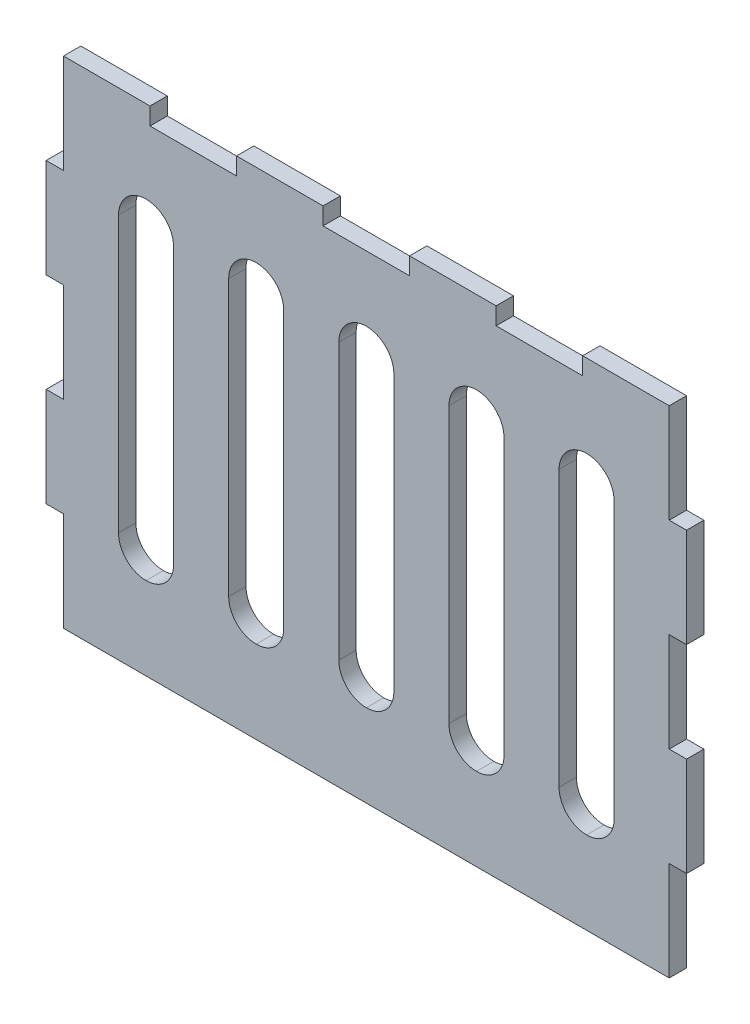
ISO-10303-21;
HEADER;
FILE_DESCRIPTION(('STEP AP214'),'2;1');
FILE_NAME('part.step','',(''),(''),'','','');
FILE_SCHEMA(('AUTOMOTIVE_DESIGN { 1 0 10303 214 1 1 1 1 }'));
ENDSEC;
DATA;
#1=APPLICATION_CONTEXT('core data for automotive mechanical design processes');
#2=APPLICATION_PROTOCOL_DEFINITION('international standard','automotive_design',2000,#1);
#3=PRODUCT_CONTEXT('',#1,'mechanical');
#4=PRODUCT('Part','Part','',(#3));
#5=PRODUCT_RELATED_PRODUCT_CATEGORY('part','',(#4));
#6=PRODUCT_DEFINITION_FORMATION('','',#4);
#7=PRODUCT_DEFINITION_CONTEXT('part definition',#1,'design');
#8=PRODUCT_DEFINITION('design','',#6,#7);
#9=PRODUCT_DEFINITION_SHAPE('','',#8);
#10=(LENGTH_UNIT() NAMED_UNIT(*) SI_UNIT(.MILLI.,.METRE.));
#11=(NAMED_UNIT(*) PLANE_ANGLE_UNIT() SI_UNIT($,.RADIAN.));
#12=(NAMED_UNIT(*) SI_UNIT($,.STERADIAN.) SOLID_ANGLE_UNIT());
#13=UNCERTAINTY_MEASURE_WITH_UNIT(LENGTH_MEASURE(1.E-05),#10,'distance_accuracy_value','');
#14=(GEOMETRIC_REPRESENTATION_CONTEXT(3) GLOBAL_UNCERTAINTY_ASSIGNED_CONTEXT((#13)) GLOBAL_UNIT_ASSIGNED_CONTEXT((#10,
#11,#12)) REPRESENTATION_CONTEXT('',''));
#15=CARTESIAN_POINT('',(0.,0.,0.));
#16=DIRECTION('',(0.,0.,1.));
#17=DIRECTION('',(1.,0.,0.));
#18=AXIS2_PLACEMENT_3D('',#15,#16,#17);
#19=CARTESIAN_POINT('',(0.,0.,16.000000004));
#20=DIRECTION('',(0.,0.,1.));
#21=DIRECTION('',(1.,0.,0.));
#22=AXIS2_PLACEMENT_3D('',#19,#20,#21);
#23=PLANE('',#22);
#24=DIRECTION('',(0.,1.,0.));
#25=VECTOR('',#24,1.);
#26=CARTESIAN_POINT('',(183.602121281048,-137.16,16.000000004));
#27=LINE('',#26,#25);
#28=CARTESIAN_POINT('',(183.602121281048,-228.6,16.000000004));
#29=VERTEX_POINT('',#28);
#30=CARTESIAN_POINT('',(183.602121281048,-137.16,16.000000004));
#31=VERTEX_POINT('',#30);
#32=EDGE_CURVE('E435',#29,#31,#27,.T.);
#33=ORIENTED_EDGE('',*,*,#32,.T.);
#34=DIRECTION('',(1.,0.,0.));
#35=VECTOR('',#34,1.);
#36=CARTESIAN_POINT('',(183.602121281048,-137.16,16.000000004));
#37=LINE('',#36,#35);
#38=CARTESIAN_POINT('',(199.602121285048,-137.16,16.000000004));
#39=VERTEX_POINT('',#38);
#40=EDGE_CURVE('E424',#31,#39,#37,.T.);
#41=ORIENTED_EDGE('',*,*,#40,.T.);
#42=DIRECTION('',(0.,1.,0.));
#43=VECTOR('',#42,1.);
#44=CARTESIAN_POINT('',(199.602121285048,-45.7199999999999,16.000000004));
#45=LINE('',#44,#43);
#46=CARTESIAN_POINT('',(199.602121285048,-45.7199999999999,16.000000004));
#47=VERTEX_POINT('',#46);
#48=EDGE_CURVE('E434',#39,#47,#45,.T.);
#49=ORIENTED_EDGE('',*,*,#48,.T.);
#50=DIRECTION('',(-1.,0.,0.));
#51=VECTOR('',#50,1.);
#52=CARTESIAN_POINT('',(183.602121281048,-45.7199999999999,16.000000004));
#53=LINE('',#52,#51);
#54=CARTESIAN_POINT('',(183.602121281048,-45.7199999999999,16.000000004));
#55=VERTEX_POINT('',#54);
#56=EDGE_CURVE('E681',#47,#55,#53,.T.);
#57=ORIENTED_EDGE('',*,*,#56,.T.);
#58=DIRECTION('',(0.,1.,0.));
#59=VECTOR('',#58,1.);
#60=CARTESIAN_POINT('',(183.602121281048,45.7199999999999,16.000000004));
#61=LINE('',#60,#59);
#62=CARTESIAN_POINT('',(183.602121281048,45.7199999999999,16.000000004));
#63=VERTEX_POINT('',#62);
#64=EDGE_CURVE('E683',#55,#63,#61,.T.);
#65=ORIENTED_EDGE('',*,*,#64,.T.);
#66=DIRECTION('',(1.,0.,0.));
#67=VECTOR('',#66,1.);
#68=CARTESIAN_POINT('',(183.602121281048,45.7199999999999,16.000000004));
#69=LINE('',#68,#67);
#70=CARTESIAN_POINT('',(199.602121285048,45.7199999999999,16.000000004));
#71=VERTEX_POINT('',#70);
#72=EDGE_CURVE('E685',#63,#71,#69,.T.);
#73=ORIENTED_EDGE('',*,*,#72,.T.);
#74=DIRECTION('',(0.,1.,0.));
#75=VECTOR('',#74,1.);
#76=CARTESIAN_POINT('',(199.602121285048,137.16,16.000000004));
#77=LINE('',#76,#75);
#78=CARTESIAN_POINT('',(199.602121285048,137.16,16.000000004));
#79=VERTEX_POINT('',#78);
#80=EDGE_CURVE('E687',#71,#79,#77,.T.);
#81=ORIENTED_EDGE('',*,*,#80,.T.);
#82=DIRECTION('',(-1.,0.,0.));
#83=VECTOR('',#82,1.);
#84=CARTESIAN_POINT('',(183.602121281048,137.16,16.000000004));
#85=LINE('',#84,#83);
#86=CARTESIAN_POINT('',(183.602121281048,137.16,16.000000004));
#87=VERTEX_POINT('',#86);
#88=EDGE_CURVE('E689',#79,#87,#85,.T.);
#89=ORIENTED_EDGE('',*,*,#88,.T.);
#90=DIRECTION('',(0.,1.,0.));
#91=VECTOR('',#90,1.);
#92=CARTESIAN_POINT('',(183.602121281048,228.6,16.000000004));
#93=LINE('',#92,#91);
#94=CARTESIAN_POINT('',(183.602121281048,228.6,16.000000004));
#95=VERTEX_POINT('',#94);
#96=EDGE_CURVE('E691',#87,#95,#93,.T.);
#97=ORIENTED_EDGE('',*,*,#96,.T.);
#98=DIRECTION('',(-1.,0.,0.));
#99=VECTOR('',#98,1.);
#100=CARTESIAN_POINT('',(103.773549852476,228.6,16.000000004));
#101=LINE('',#100,#99);
#102=CARTESIAN_POINT('',(103.773549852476,228.6,16.000000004));
#103=VERTEX_POINT('',#102);
#104=EDGE_CURVE('E693',#95,#103,#101,.T.);
#105=ORIENTED_EDGE('',*,*,#104,.T.);
#106=DIRECTION('',(0.,-1.,0.));
#107=VECTOR('',#106,1.);
#108=CARTESIAN_POINT('',(103.773549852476,228.6,16.000000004));
#109=LINE('',#108,#107);
#110=CARTESIAN_POINT('',(103.773549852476,212.599999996,16.000000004));
#111=VERTEX_POINT('',#110);
#112=EDGE_CURVE('E695',#103,#111,#109,.T.);
#113=ORIENTED_EDGE('',*,*,#112,.T.);
#114=DIRECTION('',(-1.,0.,0.));
#115=VECTOR('',#114,1.);
#116=CARTESIAN_POINT('',(23.9449784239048,212.599999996,16.000000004));
#117=LINE('',#116,#115);
#118=CARTESIAN_POINT('',(23.9449784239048,212.599999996,16.000000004));
#119=VERTEX_POINT('',#118);
#120=EDGE_CURVE('E697',#111,#119,#117,.T.);
#121=ORIENTED_EDGE('',*,*,#120,.T.);
#122=DIRECTION('',(0.,1.,0.));
#123=VECTOR('',#122,1.);
#124=CARTESIAN_POINT('',(23.9449784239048,228.6,16.000000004));
#125=LINE('',#124,#123);
#126=CARTESIAN_POINT('',(23.9449784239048,228.6,16.000000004));
#127=VERTEX_POINT('',#126);
#128=EDGE_CURVE('E699',#119,#127,#125,.T.);
#129=ORIENTED_EDGE('',*,*,#128,.T.);
#130=DIRECTION('',(-1.,0.,0.));
#131=VECTOR('',#130,1.);
#132=CARTESIAN_POINT('',(-55.8835930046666,228.6,16.000000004));
#133=LINE('',#132,#131);
#134=CARTESIAN_POINT('',(-55.8835930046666,228.6,16.000000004));
#135=VERTEX_POINT('',#134);
#136=EDGE_CURVE('E701',#127,#135,#133,.T.);
#137=ORIENTED_EDGE('',*,*,#136,.T.);
#138=DIRECTION('',(0.,-1.,0.));
#139=VECTOR('',#138,1.);
#140=CARTESIAN_POINT('',(-55.8835930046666,228.6,16.000000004));
#141=LINE('',#140,#139);
#142=CARTESIAN_POINT('',(-55.8835930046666,212.599999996,16.000000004));
#143=VERTEX_POINT('',#142);
#144=EDGE_CURVE('E703',#135,#143,#141,.T.);
#145=ORIENTED_EDGE('',*,*,#144,.T.);
#146=DIRECTION('',(-1.,0.,0.));
#147=VECTOR('',#146,1.);
#148=CARTESIAN_POINT('',(-135.712164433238,212.599999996,16.000000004));
#149=LINE('',#148,#147);
#150=CARTESIAN_POINT('',(-135.712164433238,212.599999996,16.000000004));
#151=VERTEX_POINT('',#150);
#152=EDGE_CURVE('E705',#143,#151,#149,.T.);
#153=ORIENTED_EDGE('',*,*,#152,.T.);
#154=DIRECTION('',(0.,1.,0.));
#155=VECTOR('',#154,1.);
#156=CARTESIAN_POINT('',(-135.712164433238,228.6,16.000000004));
#157=LINE('',#156,#155);
#158=CARTESIAN_POINT('',(-135.712164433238,228.6,16.000000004));
#159=VERTEX_POINT('',#158);
#160=EDGE_CURVE('E707',#151,#159,#157,.T.);
#161=ORIENTED_EDGE('',*,*,#160,.T.);
#162=DIRECTION('',(-1.,0.,0.));
#163=VECTOR('',#162,1.);
#164=CARTESIAN_POINT('',(-215.54073586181,228.6,16.000000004));
#165=LINE('',#164,#163);
#166=CARTESIAN_POINT('',(-215.54073586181,228.6,16.000000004));
#167=VERTEX_POINT('',#166);
#168=EDGE_CURVE('E709',#159,#167,#165,.T.);
#169=ORIENTED_EDGE('',*,*,#168,.T.);
#170=DIRECTION('',(0.,-1.,0.));
#171=VECTOR('',#170,1.);
#172=CARTESIAN_POINT('',(-215.54073586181,228.6,16.000000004));
#173=LINE('',#172,#171);
#174=CARTESIAN_POINT('',(-215.54073586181,212.599999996,16.000000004));
#175=VERTEX_POINT('',#174);
#176=EDGE_CURVE('E711',#167,#175,#173,.T.);
#177=ORIENTED_EDGE('',*,*,#176,.T.);
#178=DIRECTION('',(-1.,0.,0.));
#179=VECTOR('',#178,1.);
#180=CARTESIAN_POINT('',(-295.369307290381,212.599999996,16.000000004));
#181=LINE('',#180,#179);
#182=CARTESIAN_POINT('',(-295.369307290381,212.599999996,16.000000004));
#183=VERTEX_POINT('',#182);
#184=EDGE_CURVE('E713',#175,#183,#181,.T.);
#185=ORIENTED_EDGE('',*,*,#184,.T.);
#186=DIRECTION('',(0.,1.,0.));
#187=VECTOR('',#186,1.);
#188=CARTESIAN_POINT('',(-295.369307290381,228.6,16.000000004));
#189=LINE('',#188,#187);
#190=CARTESIAN_POINT('',(-295.369307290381,228.6,16.000000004));
#191=VERTEX_POINT('',#190);
#192=EDGE_CURVE('E715',#183,#191,#189,.T.);
#193=ORIENTED_EDGE('',*,*,#192,.T.);
#194=DIRECTION('',(-1.,0.,0.));
#195=VECTOR('',#194,1.);
#196=CARTESIAN_POINT('',(-375.197878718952,228.6,16.000000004));
#197=LINE('',#196,#195);
#198=CARTESIAN_POINT('',(-375.197878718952,228.6,16.000000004));
#199=VERTEX_POINT('',#198);
#200=EDGE_CURVE('E717',#191,#199,#197,.T.);
#201=ORIENTED_EDGE('',*,*,#200,.T.);
#202=DIRECTION('',(0.,-1.,0.));
#203=VECTOR('',#202,1.);
#204=CARTESIAN_POINT('',(-375.197878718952,228.6,16.000000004));
#205=LINE('',#204,#203);
#206=CARTESIAN_POINT('',(-375.197878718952,137.16,16.000000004));
#207=VERTEX_POINT('',#206);
#208=EDGE_CURVE('E719',#199,#207,#205,.T.);
#209=ORIENTED_EDGE('',*,*,#208,.T.);
#210=DIRECTION('',(-1.,0.,0.));
#211=VECTOR('',#210,1.);
#212=CARTESIAN_POINT('',(-375.197878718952,137.16,16.000000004));
#213=LINE('',#212,#211);
#214=CARTESIAN_POINT('',(-391.197878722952,137.16,16.000000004));
#215=VERTEX_POINT('',#214);
#216=EDGE_CURVE('E721',#207,#215,#213,.T.);
#217=ORIENTED_EDGE('',*,*,#216,.T.);
#218=DIRECTION('',(0.,-1.,0.));
#219=VECTOR('',#218,1.);
#220=CARTESIAN_POINT('',(-391.197878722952,137.16,16.000000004));
#221=LINE('',#220,#219);
#222=CARTESIAN_POINT('',(-391.197878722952,45.72,16.000000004));
#223=VERTEX_POINT('',#222);
#224=EDGE_CURVE('E723',#215,#223,#221,.T.);
#225=ORIENTED_EDGE('',*,*,#224,.T.);
#226=DIRECTION('',(1.,0.,0.));
#227=VECTOR('',#226,1.);
#228=CARTESIAN_POINT('',(-375.197878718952,45.72,16.000000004));
#229=LINE('',#228,#227);
#230=CARTESIAN_POINT('',(-375.197878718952,45.72,16.000000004));
#231=VERTEX_POINT('',#230);
#232=EDGE_CURVE('E725',#223,#231,#229,.T.);
#233=ORIENTED_EDGE('',*,*,#232,.T.);
#234=DIRECTION('',(0.,-1.,0.));
#235=VECTOR('',#234,1.);
#236=CARTESIAN_POINT('',(-375.197878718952,45.72,16.000000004));
#237=LINE('',#236,#235);
#238=CARTESIAN_POINT('',(-375.197878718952,-45.72,16.000000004));
#239=VERTEX_POINT('',#238);
#240=EDGE_CURVE('E727',#231,#239,#237,.T.);
#241=ORIENTED_EDGE('',*,*,#240,.T.);
#242=DIRECTION('',(-1.,0.,0.));
#243=VECTOR('',#242,1.);
#244=CARTESIAN_POINT('',(-375.197878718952,-45.72,16.000000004));
#245=LINE('',#244,#243);
#246=CARTESIAN_POINT('',(-391.19787872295,-45.72,16.000000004));
#247=VERTEX_POINT('',#246);
#248=EDGE_CURVE('E729',#239,#247,#245,.T.);
#249=ORIENTED_EDGE('',*,*,#248,.T.);
#250=DIRECTION('',(0.,-1.,0.));
#251=VECTOR('',#250,1.);
#252=CARTESIAN_POINT('',(-391.19787872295,-45.72,16.000000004));
#253=LINE('',#252,#251);
#254=CARTESIAN_POINT('',(-391.19787872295,-137.16,16.000000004));
#255=VERTEX_POINT('',#254);
#256=EDGE_CURVE('E731',#247,#255,#253,.T.);
#257=ORIENTED_EDGE('',*,*,#256,.T.);
#258=DIRECTION('',(1.,0.,0.));
#259=VECTOR('',#258,1.);
#260=CARTESIAN_POINT('',(-375.197878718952,-137.16,16.000000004));
#261=LINE('',#260,#259);
#262=CARTESIAN_POINT('',(-375.197878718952,-137.16,16.000000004));
#263=VERTEX_POINT('',#262);
#264=EDGE_CURVE('E733',#255,#263,#261,.T.);
#265=ORIENTED_EDGE('',*,*,#264,.T.);
#266=DIRECTION('',(0.,-1.,0.));
#267=VECTOR('',#266,1.);
#268=CARTESIAN_POINT('',(-375.197878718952,-137.16,16.000000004));
#269=LINE('',#268,#267);
#270=CARTESIAN_POINT('',(-375.197878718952,-228.6,16.000000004));
#271=VERTEX_POINT('',#270);
#272=EDGE_CURVE('E735',#263,#271,#269,.T.);
#273=ORIENTED_EDGE('',*,*,#272,.T.);
#274=DIRECTION('',(1.,0.,0.));
#275=VECTOR('',#274,1.);
#276=CARTESIAN_POINT('',(-375.197878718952,-228.6,16.000000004));
#277=LINE('',#276,#275);
#278=EDGE_CURVE('E440',#271,#29,#277,.T.);
#279=ORIENTED_EDGE('',*,*,#278,.T.);
#280=EDGE_LOOP('',(#33,#41,#49,#57,#65,#73,#81,#89,#97,#105,#113,#121,#129,#137,#145,#153,#161,
#169,#177,#185,#193,#201,#209,#217,#225,#233,#241,#249,#257,#265,#273,#279));
#281=FACE_BOUND('',#280,.T.);
#282=DIRECTION('',(0.,1.,0.));
#283=VECTOR('',#282,1.);
#284=CARTESIAN_POINT('',(-273.597878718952,-152.4,16.000000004));
#285=LINE('',#284,#283);
#286=CARTESIAN_POINT('',(-273.597878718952,-127.,16.000000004));
#287=VERTEX_POINT('',#286);
#288=CARTESIAN_POINT('',(-273.597878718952,127.,16.000000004));
#289=VERTEX_POINT('',#288);
#290=EDGE_CURVE('E672',#287,#289,#285,.T.);
#291=ORIENTED_EDGE('',*,*,#290,.F.);
#292=CARTESIAN_POINT('',(-298.997878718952,-127.,16.000000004));
#293=DIRECTION('',(0.,0.,1.));
#294=DIRECTION('',(1.,0.,0.));
#295=AXIS2_PLACEMENT_3D('',#292,#293,#294);
#296=CIRCLE('',#295,25.4);
#297=CARTESIAN_POINT('',(-298.997878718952,-152.4,16.000000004));
#298=VERTEX_POINT('',#297);
#299=EDGE_CURVE('E565',#287,#298,#296,.F.);
#300=ORIENTED_EDGE('',*,*,#299,.T.);
#301=CARTESIAN_POINT('',(-298.997878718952,-127.,16.000000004));
#302=DIRECTION('',(0.,0.,1.));
#303=DIRECTION('',(1.,0.,0.));
#304=AXIS2_PLACEMENT_3D('',#301,#302,#303);
#305=CIRCLE('',#304,25.4);
#306=CARTESIAN_POINT('',(-324.397878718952,-127.,16.000000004));
#307=VERTEX_POINT('',#306);
#308=EDGE_CURVE('E546',#298,#307,#305,.F.);
#309=ORIENTED_EDGE('',*,*,#308,.T.);
#310=DIRECTION('',(0.,-1.,0.));
#311=VECTOR('',#310,1.);
#312=CARTESIAN_POINT('',(-324.397878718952,-152.4,16.000000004));
#313=LINE('',#312,#311);
#314=CARTESIAN_POINT('',(-324.397878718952,127.,16.000000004));
#315=VERTEX_POINT('',#314);
#316=EDGE_CURVE('E669',#315,#307,#313,.T.);
#317=ORIENTED_EDGE('',*,*,#316,.F.);
#318=CARTESIAN_POINT('',(-298.997878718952,127.,16.000000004));
#319=DIRECTION('',(0.,0.,1.));
#320=DIRECTION('',(1.,0.,0.));
#321=AXIS2_PLACEMENT_3D('',#318,#319,#320);
#322=CIRCLE('',#321,25.4);
#323=CARTESIAN_POINT('',(-298.997878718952,152.4,16.000000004));
#324=VERTEX_POINT('',#323);
#325=EDGE_CURVE('E542',#315,#324,#322,.F.);
#326=ORIENTED_EDGE('',*,*,#325,.T.);
#327=CARTESIAN_POINT('',(-298.997878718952,127.,16.000000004));
#328=DIRECTION('',(0.,0.,1.));
#329=DIRECTION('',(1.,0.,0.));
#330=AXIS2_PLACEMENT_3D('',#327,#328,#329);
#331=CIRCLE('',#330,25.4);
#332=EDGE_CURVE('E506',#324,#289,#331,.F.);
#333=ORIENTED_EDGE('',*,*,#332,.T.);
#334=EDGE_LOOP('',(#291,#300,#309,#317,#326,#333));
#335=FACE_BOUND('',#334,.T.);
#336=DIRECTION('',(0.,1.,0.));
#337=VECTOR('',#336,1.);
#338=CARTESIAN_POINT('',(-171.997878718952,-152.4,16.000000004));
#339=LINE('',#338,#337);
#340=CARTESIAN_POINT('',(-171.997878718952,-127.,16.000000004));
#341=VERTEX_POINT('',#340);
#342=CARTESIAN_POINT('',(-171.997878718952,127.,16.000000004));
#343=VERTEX_POINT('',#342);
#344=EDGE_CURVE('E660',#341,#343,#339,.T.);
#345=ORIENTED_EDGE('',*,*,#344,.F.);
#346=CARTESIAN_POINT('',(-197.397878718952,-127.,16.000000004));
#347=DIRECTION('',(0.,0.,1.));
#348=DIRECTION('',(1.,0.,0.));
#349=AXIS2_PLACEMENT_3D('',#346,#347,#348);
#350=CIRCLE('',#349,25.4);
#351=CARTESIAN_POINT('',(-197.397878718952,-152.4,16.000000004));
#352=VERTEX_POINT('',#351);
#353=EDGE_CURVE('E569',#341,#352,#350,.F.);
#354=ORIENTED_EDGE('',*,*,#353,.T.);
#355=CARTESIAN_POINT('',(-197.397878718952,-127.,16.000000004));
#356=DIRECTION('',(0.,0.,1.));
#357=DIRECTION('',(1.,0.,0.));
#358=AXIS2_PLACEMENT_3D('',#355,#356,#357);
#359=CIRCLE('',#358,25.4);
#360=CARTESIAN_POINT('',(-222.797878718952,-127.,16.000000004));
#361=VERTEX_POINT('',#360);
#362=EDGE_CURVE('E550',#352,#361,#359,.F.);
#363=ORIENTED_EDGE('',*,*,#362,.T.);
#364=DIRECTION('',(0.,-1.,0.));
#365=VECTOR('',#364,1.);
#366=CARTESIAN_POINT('',(-222.797878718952,-152.4,16.000000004));
#367=LINE('',#366,#365);
#368=CARTESIAN_POINT('',(-222.797878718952,127.,16.000000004));
#369=VERTEX_POINT('',#368);
#370=EDGE_CURVE('E657',#369,#361,#367,.T.);
#371=ORIENTED_EDGE('',*,*,#370,.F.);
#372=CARTESIAN_POINT('',(-197.397878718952,127.,16.000000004));
#373=DIRECTION('',(0.,0.,1.));
#374=DIRECTION('',(1.,0.,0.));
#375=AXIS2_PLACEMENT_3D('',#372,#373,#374);
#376=CIRCLE('',#375,25.4);
#377=CARTESIAN_POINT('',(-197.397878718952,152.4,16.000000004));
#378=VERTEX_POINT('',#377);
#379=EDGE_CURVE('E538',#369,#378,#376,.F.);
#380=ORIENTED_EDGE('',*,*,#379,.T.);
#381=CARTESIAN_POINT('',(-197.397878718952,127.,16.000000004));
#382=DIRECTION('',(0.,0.,1.));
#383=DIRECTION('',(1.,0.,0.));
#384=AXIS2_PLACEMENT_3D('',#381,#382,#383);
#385=CIRCLE('',#384,25.4);
#386=EDGE_CURVE('E510',#378,#343,#385,.F.);
#387=ORIENTED_EDGE('',*,*,#386,.T.);
#388=EDGE_LOOP('',(#345,#354,#363,#371,#380,#387));
#389=FACE_BOUND('',#388,.T.);
#390=DIRECTION('',(0.,1.,0.));
#391=VECTOR('',#390,1.);
#392=CARTESIAN_POINT('',(-70.3978787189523,-152.4,16.000000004));
#393=LINE('',#392,#391);
#394=CARTESIAN_POINT('',(-70.3978787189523,-127.,16.000000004));
#395=VERTEX_POINT('',#394);
#396=CARTESIAN_POINT('',(-70.3978787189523,127.,16.000000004));
#397=VERTEX_POINT('',#396);
#398=EDGE_CURVE('E648',#395,#397,#393,.T.);
#399=ORIENTED_EDGE('',*,*,#398,.F.);
#400=CARTESIAN_POINT('',(-95.7978787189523,-127.,16.000000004));
#401=DIRECTION('',(0.,0.,1.));
#402=DIRECTION('',(1.,0.,0.));
#403=AXIS2_PLACEMENT_3D('',#400,#401,#402);
#404=CIRCLE('',#403,25.4);
#405=CARTESIAN_POINT('',(-95.7978787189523,-152.4,16.000000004));
#406=VERTEX_POINT('',#405);
#407=EDGE_CURVE('E573',#395,#406,#404,.F.);
#408=ORIENTED_EDGE('',*,*,#407,.T.);
#409=CARTESIAN_POINT('',(-95.7978787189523,-127.,16.000000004));
#410=DIRECTION('',(0.,0.,1.));
#411=DIRECTION('',(1.,0.,0.));
#412=AXIS2_PLACEMENT_3D('',#409,#410,#411);
#413=CIRCLE('',#412,25.4);
#414=CARTESIAN_POINT('',(-121.197878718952,-127.,16.000000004));
#415=VERTEX_POINT('',#414);
#416=EDGE_CURVE('E554',#406,#415,#413,.F.);
#417=ORIENTED_EDGE('',*,*,#416,.T.);
#418=DIRECTION('',(0.,-1.,0.));
#419=VECTOR('',#418,1.);
#420=CARTESIAN_POINT('',(-121.197878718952,-152.4,16.000000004));
#421=LINE('',#420,#419);
#422=CARTESIAN_POINT('',(-121.197878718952,127.,16.000000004));
#423=VERTEX_POINT('',#422);
#424=EDGE_CURVE('E645',#423,#415,#421,.T.);
#425=ORIENTED_EDGE('',*,*,#424,.F.);
#426=CARTESIAN_POINT('',(-95.7978787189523,127.,16.000000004));
#427=DIRECTION('',(0.,0.,1.));
#428=DIRECTION('',(1.,0.,0.));
#429=AXIS2_PLACEMENT_3D('',#426,#427,#428);
#430=CIRCLE('',#429,25.4);
#431=CARTESIAN_POINT('',(-95.7978787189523,152.4,16.000000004));
#432=VERTEX_POINT('',#431);
#433=EDGE_CURVE('E534',#423,#432,#430,.F.);
#434=ORIENTED_EDGE('',*,*,#433,.T.);
#435=CARTESIAN_POINT('',(-95.7978787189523,127.,16.000000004));
#436=DIRECTION('',(0.,0.,1.));
#437=DIRECTION('',(1.,0.,0.));
#438=AXIS2_PLACEMENT_3D('',#435,#436,#437);
#439=CIRCLE('',#438,25.4);
#440=EDGE_CURVE('E514',#432,#397,#439,.F.);
#441=ORIENTED_EDGE('',*,*,#440,.T.);
#442=EDGE_LOOP('',(#399,#408,#417,#425,#434,#441));
#443=FACE_BOUND('',#442,.T.);
#444=DIRECTION('',(0.,1.,0.));
#445=VECTOR('',#444,1.);
#446=CARTESIAN_POINT('',(31.2021212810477,-152.4,16.000000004));
#447=LINE('',#446,#445);
#448=CARTESIAN_POINT('',(31.2021212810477,-127.,16.000000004));
#449=VERTEX_POINT('',#448);
#450=CARTESIAN_POINT('',(31.2021212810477,127.,16.000000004));
#451=VERTEX_POINT('',#450);
#452=EDGE_CURVE('E635',#449,#451,#447,.T.);
#453=ORIENTED_EDGE('',*,*,#452,.F.);
#454=CARTESIAN_POINT('',(5.80212128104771,-127.,16.000000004));
#455=DIRECTION('',(0.,0.,1.));
#456=DIRECTION('',(1.,0.,0.));
#457=AXIS2_PLACEMENT_3D('',#454,#455,#456);
#458=CIRCLE('',#457,25.4);
#459=CARTESIAN_POINT('',(5.8021212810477,-152.4,16.000000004));
#460=VERTEX_POINT('',#459);
#461=EDGE_CURVE('E577',#449,#460,#458,.F.);
#462=ORIENTED_EDGE('',*,*,#461,.T.);
#463=CARTESIAN_POINT('',(5.8021212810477,-127.,16.000000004));
#464=DIRECTION('',(0.,0.,1.));
#465=DIRECTION('',(1.,0.,0.));
#466=AXIS2_PLACEMENT_3D('',#463,#464,#465);
#467=CIRCLE('',#466,25.4);
#468=CARTESIAN_POINT('',(-19.5978787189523,-127.,16.000000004));
#469=VERTEX_POINT('',#468);
#470=EDGE_CURVE('E558',#460,#469,#467,.F.);
#471=ORIENTED_EDGE('',*,*,#470,.T.);
#472=DIRECTION('',(0.,-1.,0.));
#473=VECTOR('',#472,1.);
#474=CARTESIAN_POINT('',(-19.5978787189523,-152.4,16.000000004));
#475=LINE('',#474,#473);
#476=CARTESIAN_POINT('',(-19.5978787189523,127.,16.000000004));
#477=VERTEX_POINT('',#476);
#478=EDGE_CURVE('E632',#477,#469,#475,.T.);
#479=ORIENTED_EDGE('',*,*,#478,.F.);
#480=CARTESIAN_POINT('',(5.8021212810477,127.,16.000000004));
#481=DIRECTION('',(0.,0.,1.));
#482=DIRECTION('',(1.,0.,0.));
#483=AXIS2_PLACEMENT_3D('',#480,#481,#482);
#484=CIRCLE('',#483,25.4);
#485=CARTESIAN_POINT('',(5.80212128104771,152.4,16.000000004));
#486=VERTEX_POINT('',#485);
#487=EDGE_CURVE('E530',#477,#486,#484,.F.);
#488=ORIENTED_EDGE('',*,*,#487,.T.);
#489=CARTESIAN_POINT('',(5.80212128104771,127.,16.000000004));
#490=DIRECTION('',(0.,0.,1.));
#491=DIRECTION('',(1.,0.,0.));
#492=AXIS2_PLACEMENT_3D('',#489,#490,#491);
#493=CIRCLE('',#492,25.4);
#494=EDGE_CURVE('E518',#486,#451,#493,.F.);
#495=ORIENTED_EDGE('',*,*,#494,.T.);
#496=EDGE_LOOP('',(#453,#462,#471,#479,#488,#495));
#497=FACE_BOUND('',#496,.T.);
#498=DIRECTION('',(0.,1.,0.));
#499=VECTOR('',#498,1.);
#500=CARTESIAN_POINT('',(132.802121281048,-152.4,16.000000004));
#501=LINE('',#500,#499);
#502=CARTESIAN_POINT('',(132.802121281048,-127.,16.000000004));
#503=VERTEX_POINT('',#502);
#504=CARTESIAN_POINT('',(132.802121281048,127.,16.000000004));
#505=VERTEX_POINT('',#504);
#506=EDGE_CURVE('E627',#503,#505,#501,.T.);
#507=ORIENTED_EDGE('',*,*,#506,.F.);
#508=CARTESIAN_POINT('',(107.402121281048,-127.,16.000000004));
#509=DIRECTION('',(0.,0.,1.));
#510=DIRECTION('',(1.,0.,0.));
#511=AXIS2_PLACEMENT_3D('',#508,#509,#510);
#512=CIRCLE('',#511,25.4);
#513=CARTESIAN_POINT('',(107.402121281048,-152.4,16.000000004));
#514=VERTEX_POINT('',#513);
#515=EDGE_CURVE('E11',#503,#514,#512,.F.);
#516=ORIENTED_EDGE('',*,*,#515,.T.);
#517=CARTESIAN_POINT('',(107.402121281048,-127.,16.000000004));
#518=DIRECTION('',(0.,0.,1.));
#519=DIRECTION('',(1.,0.,0.));
#520=AXIS2_PLACEMENT_3D('',#517,#518,#519);
#521=CIRCLE('',#520,25.4);
#522=CARTESIAN_POINT('',(82.0021212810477,-127.,16.000000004));
#523=VERTEX_POINT('',#522);
#524=EDGE_CURVE('E561',#514,#523,#521,.F.);
#525=ORIENTED_EDGE('',*,*,#524,.T.);
#526=DIRECTION('',(0.,-1.,0.));
#527=VECTOR('',#526,1.);
#528=CARTESIAN_POINT('',(82.0021212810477,-152.4,16.000000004));
#529=LINE('',#528,#527);
#530=CARTESIAN_POINT('',(82.0021212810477,127.,16.000000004));
#531=VERTEX_POINT('',#530);
#532=EDGE_CURVE('E624',#531,#523,#529,.T.);
#533=ORIENTED_EDGE('',*,*,#532,.F.);
#534=CARTESIAN_POINT('',(107.402121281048,127.,16.000000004));
#535=DIRECTION('',(0.,0.,1.));
#536=DIRECTION('',(1.,0.,0.));
#537=AXIS2_PLACEMENT_3D('',#534,#535,#536);
#538=CIRCLE('',#537,25.4);
#539=CARTESIAN_POINT('',(107.402121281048,152.4,16.000000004));
#540=VERTEX_POINT('',#539);
#541=EDGE_CURVE('E526',#531,#540,#538,.F.);
#542=ORIENTED_EDGE('',*,*,#541,.T.);
#543=CARTESIAN_POINT('',(107.402121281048,127.,16.000000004));
#544=DIRECTION('',(0.,0.,1.));
#545=DIRECTION('',(1.,0.,0.));
#546=AXIS2_PLACEMENT_3D('',#543,#544,#545);
#547=CIRCLE('',#546,25.4);
#548=EDGE_CURVE('E522',#540,#505,#547,.F.);
#549=ORIENTED_EDGE('',*,*,#548,.T.);
#550=EDGE_LOOP('',(#507,#516,#525,#533,#542,#549));
#551=FACE_BOUND('',#550,.T.);
#552=ADVANCED_FACE('F34',(#281,#335,#389,#443,#497,#551),#23,.T.);
#553=CARTESIAN_POINT('',(0.,0.,0.));
#554=DIRECTION('',(0.,0.,1.));
#555=DIRECTION('',(1.,0.,0.));
#556=AXIS2_PLACEMENT_3D('',#553,#554,#555);
#557=PLANE('',#556);
#558=CARTESIAN_POINT('',(5.80212128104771,127.,0.));
#559=DIRECTION('',(0.,0.,1.));
#560=DIRECTION('',(1.,0.,0.));
#561=AXIS2_PLACEMENT_3D('',#558,#559,#560);
#562=CIRCLE('',#561,25.4);
#563=CARTESIAN_POINT('',(31.2021212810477,127.,0.));
#564=VERTEX_POINT('',#563);
#565=CARTESIAN_POINT('',(5.80212128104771,152.4,0.));
#566=VERTEX_POINT('',#565);
#567=EDGE_CURVE('E516',#564,#566,#562,.T.);
#568=ORIENTED_EDGE('',*,*,#567,.T.);
#569=CARTESIAN_POINT('',(5.8021212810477,127.,0.));
#570=DIRECTION('',(0.,0.,1.));
#571=DIRECTION('',(1.,0.,0.));
#572=AXIS2_PLACEMENT_3D('',#569,#570,#571);
#573=CIRCLE('',#572,25.4);
#574=CARTESIAN_POINT('',(-19.5978787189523,127.,0.));
#575=VERTEX_POINT('',#574);
#576=EDGE_CURVE('E528',#566,#575,#573,.T.);
#577=ORIENTED_EDGE('',*,*,#576,.T.);
#578=DIRECTION('',(0.,-1.,0.));
#579=VECTOR('',#578,1.);
#580=CARTESIAN_POINT('',(-19.5978787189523,-152.4,0.));
#581=LINE('',#580,#579);
#582=CARTESIAN_POINT('',(-19.5978787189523,-127.,0.));
#583=VERTEX_POINT('',#582);
#584=EDGE_CURVE('E640',#575,#583,#581,.T.);
#585=ORIENTED_EDGE('',*,*,#584,.T.);
#586=CARTESIAN_POINT('',(5.8021212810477,-127.,0.));
#587=DIRECTION('',(0.,0.,1.));
#588=DIRECTION('',(1.,0.,0.));
#589=AXIS2_PLACEMENT_3D('',#586,#587,#588);
#590=CIRCLE('',#589,25.4);
#591=CARTESIAN_POINT('',(5.8021212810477,-152.4,0.));
#592=VERTEX_POINT('',#591);
#593=EDGE_CURVE('E556',#583,#592,#590,.T.);
#594=ORIENTED_EDGE('',*,*,#593,.T.);
#595=CARTESIAN_POINT('',(5.80212128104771,-127.,0.));
#596=DIRECTION('',(0.,0.,1.));
#597=DIRECTION('',(1.,0.,0.));
#598=AXIS2_PLACEMENT_3D('',#595,#596,#597);
#599=CIRCLE('',#598,25.4);
#600=CARTESIAN_POINT('',(31.2021212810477,-127.,0.));
#601=VERTEX_POINT('',#600);
#602=EDGE_CURVE('E575',#592,#601,#599,.T.);
#603=ORIENTED_EDGE('',*,*,#602,.T.);
#604=DIRECTION('',(0.,1.,0.));
#605=VECTOR('',#604,1.);
#606=CARTESIAN_POINT('',(31.2021212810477,-152.4,0.));
#607=LINE('',#606,#605);
#608=EDGE_CURVE('E636',#601,#564,#607,.T.);
#609=ORIENTED_EDGE('',*,*,#608,.T.);
#610=EDGE_LOOP('',(#568,#577,#585,#594,#603,#609));
#611=FACE_BOUND('',#610,.T.);
#612=CARTESIAN_POINT('',(-197.397878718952,127.,0.));
#613=DIRECTION('',(0.,0.,1.));
#614=DIRECTION('',(1.,0.,0.));
#615=AXIS2_PLACEMENT_3D('',#612,#613,#614);
#616=CIRCLE('',#615,25.4);
#617=CARTESIAN_POINT('',(-171.997878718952,127.,0.));
#618=VERTEX_POINT('',#617);
#619=CARTESIAN_POINT('',(-197.397878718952,152.4,0.));
#620=VERTEX_POINT('',#619);
#621=EDGE_CURVE('E508',#618,#620,#616,.T.);
#622=ORIENTED_EDGE('',*,*,#621,.T.);
#623=CARTESIAN_POINT('',(-197.397878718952,127.,0.));
#624=DIRECTION('',(0.,0.,1.));
#625=DIRECTION('',(1.,0.,0.));
#626=AXIS2_PLACEMENT_3D('',#623,#624,#625);
#627=CIRCLE('',#626,25.4);
#628=CARTESIAN_POINT('',(-222.797878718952,127.,0.));
#629=VERTEX_POINT('',#628);
#630=EDGE_CURVE('E536',#620,#629,#627,.T.);
#631=ORIENTED_EDGE('',*,*,#630,.T.);
#632=DIRECTION('',(0.,-1.,0.));
#633=VECTOR('',#632,1.);
#634=CARTESIAN_POINT('',(-222.797878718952,-152.4,0.));
#635=LINE('',#634,#633);
#636=CARTESIAN_POINT('',(-222.797878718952,-127.,0.));
#637=VERTEX_POINT('',#636);
#638=EDGE_CURVE('E652',#629,#637,#635,.T.);
#639=ORIENTED_EDGE('',*,*,#638,.T.);
#640=CARTESIAN_POINT('',(-197.397878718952,-127.,0.));
#641=DIRECTION('',(0.,0.,1.));
#642=DIRECTION('',(1.,0.,0.));
#643=AXIS2_PLACEMENT_3D('',#640,#641,#642);
#644=CIRCLE('',#643,25.4);
#645=CARTESIAN_POINT('',(-197.397878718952,-152.4,0.));
#646=VERTEX_POINT('',#645);
#647=EDGE_CURVE('E548',#637,#646,#644,.T.);
#648=ORIENTED_EDGE('',*,*,#647,.T.);
#649=CARTESIAN_POINT('',(-197.397878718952,-127.,0.));
#650=DIRECTION('',(0.,0.,1.));
#651=DIRECTION('',(1.,0.,0.));
#652=AXIS2_PLACEMENT_3D('',#649,#650,#651);
#653=CIRCLE('',#652,25.4);
#654=CARTESIAN_POINT('',(-171.997878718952,-127.,0.));
#655=VERTEX_POINT('',#654);
#656=EDGE_CURVE('E567',#646,#655,#653,.T.);
#657=ORIENTED_EDGE('',*,*,#656,.T.);
#658=DIRECTION('',(0.,1.,0.));
#659=VECTOR('',#658,1.);
#660=CARTESIAN_POINT('',(-171.997878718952,-152.4,0.));
#661=LINE('',#660,#659);
#662=EDGE_CURVE('E661',#655,#618,#661,.T.);
#663=ORIENTED_EDGE('',*,*,#662,.T.);
#664=EDGE_LOOP('',(#622,#631,#639,#648,#657,#663));
#665=FACE_BOUND('',#664,.T.);
#666=DIRECTION('',(0.,1.,0.));
#667=VECTOR('',#666,1.);
#668=CARTESIAN_POINT('',(183.602121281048,-137.16,0.));
#669=LINE('',#668,#667);
#670=CARTESIAN_POINT('',(183.602121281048,-228.6,0.));
#671=VERTEX_POINT('',#670);
#672=CARTESIAN_POINT('',(183.602121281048,-137.16,0.));
#673=VERTEX_POINT('',#672);
#674=EDGE_CURVE('E448',#671,#673,#669,.T.);
#675=ORIENTED_EDGE('',*,*,#674,.F.);
#676=DIRECTION('',(1.,0.,0.));
#677=VECTOR('',#676,1.);
#678=CARTESIAN_POINT('',(-375.197878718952,-228.6,0.));
#679=LINE('',#678,#677);
#680=CARTESIAN_POINT('',(-375.197878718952,-228.6,0.));
#681=VERTEX_POINT('',#680);
#682=EDGE_CURVE('E444',#681,#671,#679,.T.);
#683=ORIENTED_EDGE('',*,*,#682,.F.);
#684=DIRECTION('',(0.,-1.,0.));
#685=VECTOR('',#684,1.);
#686=CARTESIAN_POINT('',(-375.197878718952,-137.16,0.));
#687=LINE('',#686,#685);
#688=CARTESIAN_POINT('',(-375.197878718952,-137.16,0.));
#689=VERTEX_POINT('',#688);
#690=EDGE_CURVE('E798',#689,#681,#687,.T.);
#691=ORIENTED_EDGE('',*,*,#690,.F.);
#692=DIRECTION('',(1.,0.,0.));
#693=VECTOR('',#692,1.);
#694=CARTESIAN_POINT('',(-375.197878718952,-137.16,0.));
#695=LINE('',#694,#693);
#696=CARTESIAN_POINT('',(-391.19787872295,-137.16,0.));
#697=VERTEX_POINT('',#696);
#698=EDGE_CURVE('E796',#697,#689,#695,.T.);
#699=ORIENTED_EDGE('',*,*,#698,.F.);
#700=DIRECTION('',(0.,-1.,0.));
#701=VECTOR('',#700,1.);
#702=CARTESIAN_POINT('',(-391.19787872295,-45.72,0.));
#703=LINE('',#702,#701);
#704=CARTESIAN_POINT('',(-391.19787872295,-45.72,0.));
#705=VERTEX_POINT('',#704);
#706=EDGE_CURVE('E794',#705,#697,#703,.T.);
#707=ORIENTED_EDGE('',*,*,#706,.F.);
#708=DIRECTION('',(-1.,0.,0.));
#709=VECTOR('',#708,1.);
#710=CARTESIAN_POINT('',(-375.197878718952,-45.72,0.));
#711=LINE('',#710,#709);
#712=CARTESIAN_POINT('',(-375.197878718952,-45.72,0.));
#713=VERTEX_POINT('',#712);
#714=EDGE_CURVE('E792',#713,#705,#711,.T.);
#715=ORIENTED_EDGE('',*,*,#714,.F.);
#716=DIRECTION('',(0.,-1.,0.));
#717=VECTOR('',#716,1.);
#718=CARTESIAN_POINT('',(-375.197878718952,45.72,0.));
#719=LINE('',#718,#717);
#720=CARTESIAN_POINT('',(-375.197878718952,45.72,0.));
#721=VERTEX_POINT('',#720);
#722=EDGE_CURVE('E790',#721,#713,#719,.T.);
#723=ORIENTED_EDGE('',*,*,#722,.F.);
#724=DIRECTION('',(1.,0.,0.));
#725=VECTOR('',#724,1.);
#726=CARTESIAN_POINT('',(-375.197878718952,45.72,0.));
#727=LINE('',#726,#725);
#728=CARTESIAN_POINT('',(-391.197878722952,45.72,0.));
#729=VERTEX_POINT('',#728);
#730=EDGE_CURVE('E788',#729,#721,#727,.T.);
#731=ORIENTED_EDGE('',*,*,#730,.F.);
#732=DIRECTION('',(0.,-1.,0.));
#733=VECTOR('',#732,1.);
#734=CARTESIAN_POINT('',(-391.197878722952,137.16,0.));
#735=LINE('',#734,#733);
#736=CARTESIAN_POINT('',(-391.197878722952,137.16,0.));
#737=VERTEX_POINT('',#736);
#738=EDGE_CURVE('E786',#737,#729,#735,.T.);
#739=ORIENTED_EDGE('',*,*,#738,.F.);
#740=DIRECTION('',(-1.,0.,0.));
#741=VECTOR('',#740,1.);
#742=CARTESIAN_POINT('',(-375.197878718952,137.16,0.));
#743=LINE('',#742,#741);
#744=CARTESIAN_POINT('',(-375.197878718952,137.16,0.));
#745=VERTEX_POINT('',#744);
#746=EDGE_CURVE('E784',#745,#737,#743,.T.);
#747=ORIENTED_EDGE('',*,*,#746,.F.);
#748=DIRECTION('',(0.,-1.,0.));
#749=VECTOR('',#748,1.);
#750=CARTESIAN_POINT('',(-375.197878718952,228.6,0.));
#751=LINE('',#750,#749);
#752=CARTESIAN_POINT('',(-375.197878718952,228.6,0.));
#753=VERTEX_POINT('',#752);
#754=EDGE_CURVE('E782',#753,#745,#751,.T.);
#755=ORIENTED_EDGE('',*,*,#754,.F.);
#756=DIRECTION('',(-1.,0.,0.));
#757=VECTOR('',#756,1.);
#758=CARTESIAN_POINT('',(-375.197878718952,228.6,0.));
#759=LINE('',#758,#757);
#760=CARTESIAN_POINT('',(-295.369307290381,228.6,0.));
#761=VERTEX_POINT('',#760);
#762=EDGE_CURVE('E780',#761,#753,#759,.T.);
#763=ORIENTED_EDGE('',*,*,#762,.F.);
#764=DIRECTION('',(0.,1.,0.));
#765=VECTOR('',#764,1.);
#766=CARTESIAN_POINT('',(-295.369307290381,228.6,0.));
#767=LINE('',#766,#765);
#768=CARTESIAN_POINT('',(-295.369307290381,212.599999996,0.));
#769=VERTEX_POINT('',#768);
#770=EDGE_CURVE('E778',#769,#761,#767,.T.);
#771=ORIENTED_EDGE('',*,*,#770,.F.);
#772=DIRECTION('',(-1.,0.,0.));
#773=VECTOR('',#772,1.);
#774=CARTESIAN_POINT('',(-295.369307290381,212.599999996,0.));
#775=LINE('',#774,#773);
#776=CARTESIAN_POINT('',(-215.54073586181,212.599999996,0.));
#777=VERTEX_POINT('',#776);
#778=EDGE_CURVE('E776',#777,#769,#775,.T.);
#779=ORIENTED_EDGE('',*,*,#778,.F.);
#780=DIRECTION('',(0.,-1.,0.));
#781=VECTOR('',#780,1.);
#782=CARTESIAN_POINT('',(-215.54073586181,228.6,0.));
#783=LINE('',#782,#781);
#784=CARTESIAN_POINT('',(-215.54073586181,228.6,0.));
#785=VERTEX_POINT('',#784);
#786=EDGE_CURVE('E774',#785,#777,#783,.T.);
#787=ORIENTED_EDGE('',*,*,#786,.F.);
#788=DIRECTION('',(-1.,0.,0.));
#789=VECTOR('',#788,1.);
#790=CARTESIAN_POINT('',(-215.54073586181,228.6,0.));
#791=LINE('',#790,#789);
#792=CARTESIAN_POINT('',(-135.712164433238,228.6,0.));
#793=VERTEX_POINT('',#792);
#794=EDGE_CURVE('E772',#793,#785,#791,.T.);
#795=ORIENTED_EDGE('',*,*,#794,.F.);
#796=DIRECTION('',(0.,1.,0.));
#797=VECTOR('',#796,1.);
#798=CARTESIAN_POINT('',(-135.712164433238,228.6,0.));
#799=LINE('',#798,#797);
#800=CARTESIAN_POINT('',(-135.712164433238,212.599999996,0.));
#801=VERTEX_POINT('',#800);
#802=EDGE_CURVE('E770',#801,#793,#799,.T.);
#803=ORIENTED_EDGE('',*,*,#802,.F.);
#804=DIRECTION('',(-1.,0.,0.));
#805=VECTOR('',#804,1.);
#806=CARTESIAN_POINT('',(-135.712164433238,212.599999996,0.));
#807=LINE('',#806,#805);
#808=CARTESIAN_POINT('',(-55.8835930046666,212.599999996,0.));
#809=VERTEX_POINT('',#808);
#810=EDGE_CURVE('E768',#809,#801,#807,.T.);
#811=ORIENTED_EDGE('',*,*,#810,.F.);
#812=DIRECTION('',(0.,-1.,0.));
#813=VECTOR('',#812,1.);
#814=CARTESIAN_POINT('',(-55.8835930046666,228.6,0.));
#815=LINE('',#814,#813);
#816=CARTESIAN_POINT('',(-55.8835930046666,228.6,0.));
#817=VERTEX_POINT('',#816);
#818=EDGE_CURVE('E766',#817,#809,#815,.T.);
#819=ORIENTED_EDGE('',*,*,#818,.F.);
#820=DIRECTION('',(-1.,0.,0.));
#821=VECTOR('',#820,1.);
#822=CARTESIAN_POINT('',(-55.8835930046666,228.6,0.));
#823=LINE('',#822,#821);
#824=CARTESIAN_POINT('',(23.9449784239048,228.6,0.));
#825=VERTEX_POINT('',#824);
#826=EDGE_CURVE('E764',#825,#817,#823,.T.);
#827=ORIENTED_EDGE('',*,*,#826,.F.);
#828=DIRECTION('',(0.,1.,0.));
#829=VECTOR('',#828,1.);
#830=CARTESIAN_POINT('',(23.9449784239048,228.6,0.));
#831=LINE('',#830,#829);
#832=CARTESIAN_POINT('',(23.9449784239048,212.599999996,0.));
#833=VERTEX_POINT('',#832);
#834=EDGE_CURVE('E762',#833,#825,#831,.T.);
#835=ORIENTED_EDGE('',*,*,#834,.F.);
#836=DIRECTION('',(-1.,0.,0.));
#837=VECTOR('',#836,1.);
#838=CARTESIAN_POINT('',(23.9449784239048,212.599999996,0.));
#839=LINE('',#838,#837);
#840=CARTESIAN_POINT('',(103.773549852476,212.599999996,0.));
#841=VERTEX_POINT('',#840);
#842=EDGE_CURVE('E760',#841,#833,#839,.T.);
#843=ORIENTED_EDGE('',*,*,#842,.F.);
#844=DIRECTION('',(0.,-1.,0.));
#845=VECTOR('',#844,1.);
#846=CARTESIAN_POINT('',(103.773549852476,228.6,0.));
#847=LINE('',#846,#845);
#848=CARTESIAN_POINT('',(103.773549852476,228.6,0.));
#849=VERTEX_POINT('',#848);
#850=EDGE_CURVE('E758',#849,#841,#847,.T.);
#851=ORIENTED_EDGE('',*,*,#850,.F.);
#852=DIRECTION('',(-1.,0.,0.));
#853=VECTOR('',#852,1.);
#854=CARTESIAN_POINT('',(103.773549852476,228.6,0.));
#855=LINE('',#854,#853);
#856=CARTESIAN_POINT('',(183.602121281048,228.6,0.));
#857=VERTEX_POINT('',#856);
#858=EDGE_CURVE('E756',#857,#849,#855,.T.);
#859=ORIENTED_EDGE('',*,*,#858,.F.);
#860=DIRECTION('',(0.,1.,0.));
#861=VECTOR('',#860,1.);
#862=CARTESIAN_POINT('',(183.602121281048,228.6,0.));
#863=LINE('',#862,#861);
#864=CARTESIAN_POINT('',(183.602121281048,137.16,0.));
#865=VERTEX_POINT('',#864);
#866=EDGE_CURVE('E754',#865,#857,#863,.T.);
#867=ORIENTED_EDGE('',*,*,#866,.F.);
#868=DIRECTION('',(-1.,0.,0.));
#869=VECTOR('',#868,1.);
#870=CARTESIAN_POINT('',(183.602121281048,137.16,0.));
#871=LINE('',#870,#869);
#872=CARTESIAN_POINT('',(199.602121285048,137.16,0.));
#873=VERTEX_POINT('',#872);
#874=EDGE_CURVE('E752',#873,#865,#871,.T.);
#875=ORIENTED_EDGE('',*,*,#874,.F.);
#876=DIRECTION('',(0.,1.,0.));
#877=VECTOR('',#876,1.);
#878=CARTESIAN_POINT('',(199.602121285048,137.16,0.));
#879=LINE('',#878,#877);
#880=CARTESIAN_POINT('',(199.602121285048,45.7199999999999,0.));
#881=VERTEX_POINT('',#880);
#882=EDGE_CURVE('E750',#881,#873,#879,.T.);
#883=ORIENTED_EDGE('',*,*,#882,.F.);
#884=DIRECTION('',(1.,0.,0.));
#885=VECTOR('',#884,1.);
#886=CARTESIAN_POINT('',(183.602121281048,45.7199999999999,0.));
#887=LINE('',#886,#885);
#888=CARTESIAN_POINT('',(183.602121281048,45.7199999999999,0.));
#889=VERTEX_POINT('',#888);
#890=EDGE_CURVE('E748',#889,#881,#887,.T.);
#891=ORIENTED_EDGE('',*,*,#890,.F.);
#892=DIRECTION('',(0.,1.,0.));
#893=VECTOR('',#892,1.);
#894=CARTESIAN_POINT('',(183.602121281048,45.7199999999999,0.));
#895=LINE('',#894,#893);
#896=CARTESIAN_POINT('',(183.602121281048,-45.7199999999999,0.));
#897=VERTEX_POINT('',#896);
#898=EDGE_CURVE('E746',#897,#889,#895,.T.);
#899=ORIENTED_EDGE('',*,*,#898,.F.);
#900=DIRECTION('',(-1.,0.,0.));
#901=VECTOR('',#900,1.);
#902=CARTESIAN_POINT('',(183.602121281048,-45.7199999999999,0.));
#903=LINE('',#902,#901);
#904=CARTESIAN_POINT('',(199.602121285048,-45.7199999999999,0.));
#905=VERTEX_POINT('',#904);
#906=EDGE_CURVE('E744',#905,#897,#903,.T.);
#907=ORIENTED_EDGE('',*,*,#906,.F.);
#908=DIRECTION('',(0.,1.,0.));
#909=VECTOR('',#908,1.);
#910=CARTESIAN_POINT('',(199.602121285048,-45.7199999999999,0.));
#911=LINE('',#910,#909);
#912=CARTESIAN_POINT('',(199.602121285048,-137.16,0.));
#913=VERTEX_POINT('',#912);
#914=EDGE_CURVE('E742',#913,#905,#911,.T.);
#915=ORIENTED_EDGE('',*,*,#914,.F.);
#916=DIRECTION('',(1.,0.,0.));
#917=VECTOR('',#916,1.);
#918=CARTESIAN_POINT('',(183.602121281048,-137.16,0.));
#919=LINE('',#918,#917);
#920=EDGE_CURVE('E740',#673,#913,#919,.T.);
#921=ORIENTED_EDGE('',*,*,#920,.F.);
#922=EDGE_LOOP('',(#675,#683,#691,#699,#707,#715,#723,#731,#739,#747,#755,#763,#771,#779,#787,
#795,#803,#811,#819,#827,#835,#843,#851,#859,#867,#875,#883,#891,#899,#907,#915,#921));
#923=FACE_BOUND('',#922,.T.);
#924=CARTESIAN_POINT('',(-298.997878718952,127.,0.));
#925=DIRECTION('',(0.,0.,1.));
#926=DIRECTION('',(1.,0.,0.));
#927=AXIS2_PLACEMENT_3D('',#924,#925,#926);
#928=CIRCLE('',#927,25.4);
#929=CARTESIAN_POINT('',(-273.597878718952,127.,0.));
#930=VERTEX_POINT('',#929);
#931=CARTESIAN_POINT('',(-298.997878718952,152.4,0.));
#932=VERTEX_POINT('',#931);
#933=EDGE_CURVE('E504',#930,#932,#928,.T.);
#934=ORIENTED_EDGE('',*,*,#933,.T.);
#935=CARTESIAN_POINT('',(-298.997878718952,127.,0.));
#936=DIRECTION('',(0.,0.,1.));
#937=DIRECTION('',(1.,0.,0.));
#938=AXIS2_PLACEMENT_3D('',#935,#936,#937);
#939=CIRCLE('',#938,25.4);
#940=CARTESIAN_POINT('',(-324.397878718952,127.,0.));
#941=VERTEX_POINT('',#940);
#942=EDGE_CURVE('E540',#932,#941,#939,.T.);
#943=ORIENTED_EDGE('',*,*,#942,.T.);
#944=DIRECTION('',(0.,-1.,0.));
#945=VECTOR('',#944,1.);
#946=CARTESIAN_POINT('',(-324.397878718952,-152.4,0.));
#947=LINE('',#946,#945);
#948=CARTESIAN_POINT('',(-324.397878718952,-127.,0.));
#949=VERTEX_POINT('',#948);
#950=EDGE_CURVE('E664',#941,#949,#947,.T.);
#951=ORIENTED_EDGE('',*,*,#950,.T.);
#952=CARTESIAN_POINT('',(-298.997878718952,-127.,0.));
#953=DIRECTION('',(0.,0.,1.));
#954=DIRECTION('',(1.,0.,0.));
#955=AXIS2_PLACEMENT_3D('',#952,#953,#954);
#956=CIRCLE('',#955,25.4);
#957=CARTESIAN_POINT('',(-298.997878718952,-152.4,0.));
#958=VERTEX_POINT('',#957);
#959=EDGE_CURVE('E544',#949,#958,#956,.T.);
#960=ORIENTED_EDGE('',*,*,#959,.T.);
#961=CARTESIAN_POINT('',(-298.997878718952,-127.,0.));
#962=DIRECTION('',(0.,0.,1.));
#963=DIRECTION('',(1.,0.,0.));
#964=AXIS2_PLACEMENT_3D('',#961,#962,#963);
#965=CIRCLE('',#964,25.4);
#966=CARTESIAN_POINT('',(-273.597878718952,-127.,0.));
#967=VERTEX_POINT('',#966);
#968=EDGE_CURVE('E563',#958,#967,#965,.T.);
#969=ORIENTED_EDGE('',*,*,#968,.T.);
#970=DIRECTION('',(0.,1.,0.));
#971=VECTOR('',#970,1.);
#972=CARTESIAN_POINT('',(-273.597878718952,-152.4,0.));
#973=LINE('',#972,#971);
#974=EDGE_CURVE('E673',#967,#930,#973,.T.);
#975=ORIENTED_EDGE('',*,*,#974,.T.);
#976=EDGE_LOOP('',(#934,#943,#951,#960,#969,#975));
#977=FACE_BOUND('',#976,.T.);
#978=CARTESIAN_POINT('',(-95.7978787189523,127.,0.));
#979=DIRECTION('',(0.,0.,1.));
#980=DIRECTION('',(1.,0.,0.));
#981=AXIS2_PLACEMENT_3D('',#978,#979,#980);
#982=CIRCLE('',#981,25.4);
#983=CARTESIAN_POINT('',(-70.3978787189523,127.,0.));
#984=VERTEX_POINT('',#983);
#985=CARTESIAN_POINT('',(-95.7978787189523,152.4,0.));
#986=VERTEX_POINT('',#985);
#987=EDGE_CURVE('E512',#984,#986,#982,.T.);
#988=ORIENTED_EDGE('',*,*,#987,.T.);
#989=CARTESIAN_POINT('',(-95.7978787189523,127.,0.));
#990=DIRECTION('',(0.,0.,1.));
#991=DIRECTION('',(1.,0.,0.));
#992=AXIS2_PLACEMENT_3D('',#989,#990,#991);
#993=CIRCLE('',#992,25.4);
#994=CARTESIAN_POINT('',(-121.197878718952,127.,0.));
#995=VERTEX_POINT('',#994);
#996=EDGE_CURVE('E532',#986,#995,#993,.T.);
#997=ORIENTED_EDGE('',*,*,#996,.T.);
#998=DIRECTION('',(0.,-1.,0.));
#999=VECTOR('',#998,1.);
#1000=CARTESIAN_POINT('',(-121.197878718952,-152.4,0.));
#1001=LINE('',#1000,#999);
#1002=CARTESIAN_POINT('',(-121.197878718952,-127.,0.));
#1003=VERTEX_POINT('',#1002);
#1004=EDGE_CURVE('E639',#995,#1003,#1001,.T.);
#1005=ORIENTED_EDGE('',*,*,#1004,.T.);
#1006=CARTESIAN_POINT('',(-95.7978787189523,-127.,0.));
#1007=DIRECTION('',(0.,0.,1.));
#1008=DIRECTION('',(1.,0.,0.));
#1009=AXIS2_PLACEMENT_3D('',#1006,#1007,#1008);
#1010=CIRCLE('',#1009,25.4);
#1011=CARTESIAN_POINT('',(-95.7978787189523,-152.4,0.));
#1012=VERTEX_POINT('',#1011);
#1013=EDGE_CURVE('E552',#1003,#1012,#1010,.T.);
#1014=ORIENTED_EDGE('',*,*,#1013,.T.);
#1015=CARTESIAN_POINT('',(-95.7978787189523,-127.,0.));
#1016=DIRECTION('',(0.,0.,1.));
#1017=DIRECTION('',(1.,0.,0.));
#1018=AXIS2_PLACEMENT_3D('',#1015,#1016,#1017);
#1019=CIRCLE('',#1018,25.4);
#1020=CARTESIAN_POINT('',(-70.3978787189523,-127.,0.));
#1021=VERTEX_POINT('',#1020);
#1022=EDGE_CURVE('E571',#1012,#1021,#1019,.T.);
#1023=ORIENTED_EDGE('',*,*,#1022,.T.);
#1024=DIRECTION('',(0.,1.,0.));
#1025=VECTOR('',#1024,1.);
#1026=CARTESIAN_POINT('',(-70.3978787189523,-152.4,0.));
#1027=LINE('',#1026,#1025);
#1028=EDGE_CURVE('E649',#1021,#984,#1027,.T.);
#1029=ORIENTED_EDGE('',*,*,#1028,.T.);
#1030=EDGE_LOOP('',(#988,#997,#1005,#1014,#1023,#1029));
#1031=FACE_BOUND('',#1030,.T.);
#1032=CARTESIAN_POINT('',(107.402121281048,127.,0.));
#1033=DIRECTION('',(0.,0.,1.));
#1034=DIRECTION('',(1.,0.,0.));
#1035=AXIS2_PLACEMENT_3D('',#1032,#1033,#1034);
#1036=CIRCLE('',#1035,25.4);
#1037=CARTESIAN_POINT('',(132.802121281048,127.,0.));
#1038=VERTEX_POINT('',#1037);
#1039=CARTESIAN_POINT('',(107.402121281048,152.4,0.));
#1040=VERTEX_POINT('',#1039);
#1041=EDGE_CURVE('E520',#1038,#1040,#1036,.T.);
#1042=ORIENTED_EDGE('',*,*,#1041,.T.);
#1043=CARTESIAN_POINT('',(107.402121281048,127.,0.));
#1044=DIRECTION('',(0.,0.,1.));
#1045=DIRECTION('',(1.,0.,0.));
#1046=AXIS2_PLACEMENT_3D('',#1043,#1044,#1045);
#1047=CIRCLE('',#1046,25.4);
#1048=CARTESIAN_POINT('',(82.0021212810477,127.,0.));
#1049=VERTEX_POINT('',#1048);
#1050=EDGE_CURVE('E524',#1040,#1049,#1047,.T.);
#1051=ORIENTED_EDGE('',*,*,#1050,.T.);
#1052=DIRECTION('',(0.,-1.,0.));
#1053=VECTOR('',#1052,1.);
#1054=CARTESIAN_POINT('',(82.0021212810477,-152.4,0.));
#1055=LINE('',#1054,#1053);
#1056=CARTESIAN_POINT('',(82.0021212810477,-127.,0.));
#1057=VERTEX_POINT('',#1056);
#1058=EDGE_CURVE('E583',#1049,#1057,#1055,.T.);
#1059=ORIENTED_EDGE('',*,*,#1058,.T.);
#1060=CARTESIAN_POINT('',(107.402121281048,-127.,0.));
#1061=DIRECTION('',(0.,0.,1.));
#1062=DIRECTION('',(1.,0.,0.));
#1063=AXIS2_PLACEMENT_3D('',#1060,#1061,#1062);
#1064=CIRCLE('',#1063,25.4);
#1065=CARTESIAN_POINT('',(107.402121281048,-152.4,0.));
#1066=VERTEX_POINT('',#1065);
#1067=EDGE_CURVE('E57',#1057,#1066,#1064,.T.);
#1068=ORIENTED_EDGE('',*,*,#1067,.T.);
#1069=CARTESIAN_POINT('',(107.402121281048,-127.,0.));
#1070=DIRECTION('',(0.,0.,1.));
#1071=DIRECTION('',(1.,0.,0.));
#1072=AXIS2_PLACEMENT_3D('',#1069,#1070,#1071);
#1073=CIRCLE('',#1072,25.4);
#1074=CARTESIAN_POINT('',(132.802121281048,-127.,0.));
#1075=VERTEX_POINT('',#1074);
#1076=EDGE_CURVE('E43',#1066,#1075,#1073,.T.);
#1077=ORIENTED_EDGE('',*,*,#1076,.T.);
#1078=DIRECTION('',(0.,1.,0.));
#1079=VECTOR('',#1078,1.);
#1080=CARTESIAN_POINT('',(132.802121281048,-152.4,0.));
#1081=LINE('',#1080,#1079);
#1082=EDGE_CURVE('E619',#1075,#1038,#1081,.T.);
#1083=ORIENTED_EDGE('',*,*,#1082,.T.);
#1084=EDGE_LOOP('',(#1042,#1051,#1059,#1068,#1077,#1083));
#1085=FACE_BOUND('',#1084,.T.);
#1086=ADVANCED_FACE('F618',(#611,#665,#923,#977,#1031,#1085),#557,.F.);
#1087=CARTESIAN_POINT('',(183.602121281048,-137.16,16.000000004));
#1088=DIRECTION('',(-1.,0.,0.));
#1089=DIRECTION('',(0.,0.,1.));
#1090=AXIS2_PLACEMENT_3D('',#1087,#1088,#1089);
#1091=PLANE('',#1090);
#1092=ORIENTED_EDGE('',*,*,#674,.T.);
#1093=DIRECTION('',(0.,0.,-1.));
#1094=VECTOR('',#1093,1.);
#1095=CARTESIAN_POINT('',(183.602121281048,-137.16,16.000000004));
#1096=LINE('',#1095,#1094);
#1097=EDGE_CURVE('E428',#31,#673,#1096,.T.);
#1098=ORIENTED_EDGE('',*,*,#1097,.F.);
#1099=ORIENTED_EDGE('',*,*,#32,.F.);
#1100=DIRECTION('',(0.,0.,-1.));
#1101=VECTOR('',#1100,1.);
#1102=CARTESIAN_POINT('',(183.602121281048,-228.6,16.000000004));
#1103=LINE('',#1102,#1101);
#1104=EDGE_CURVE('E738',#29,#671,#1103,.T.);
#1105=ORIENTED_EDGE('',*,*,#1104,.T.);
#1106=EDGE_LOOP('',(#1092,#1098,#1099,#1105));
#1107=FACE_BOUND('',#1106,.T.);
#1108=ADVANCED_FACE('F446',(#1107),#1091,.F.);
#1109=CARTESIAN_POINT('',(183.602121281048,-137.16,16.000000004));
#1110=DIRECTION('',(0.,1.,0.));
#1111=DIRECTION('',(0.,0.,1.));
#1112=AXIS2_PLACEMENT_3D('',#1109,#1110,#1111);
#1113=PLANE('',#1112);
#1114=ORIENTED_EDGE('',*,*,#920,.T.);
#1115=DIRECTION('',(0.,0.,-1.));
#1116=VECTOR('',#1115,1.);
#1117=CARTESIAN_POINT('',(199.602121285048,-137.16,16.000000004));
#1118=LINE('',#1117,#1116);
#1119=EDGE_CURVE('E431',#39,#913,#1118,.T.);
#1120=ORIENTED_EDGE('',*,*,#1119,.F.);
#1121=ORIENTED_EDGE('',*,*,#40,.F.);
#1122=ORIENTED_EDGE('',*,*,#1097,.T.);
#1123=EDGE_LOOP('',(#1114,#1120,#1121,#1122));
#1124=FACE_BOUND('',#1123,.T.);
#1125=ADVANCED_FACE('F426',(#1124),#1113,.F.);
#1126=CARTESIAN_POINT('',(199.602121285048,-45.7199999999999,16.000000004));
#1127=DIRECTION('',(-1.,0.,0.));
#1128=DIRECTION('',(0.,0.,1.));
#1129=AXIS2_PLACEMENT_3D('',#1126,#1127,#1128);
#1130=PLANE('',#1129);
#1131=ORIENTED_EDGE('',*,*,#914,.T.);
#1132=DIRECTION('',(0.,0.,-1.));
#1133=VECTOR('',#1132,1.);
#1134=CARTESIAN_POINT('',(199.602121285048,-45.7199999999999,16.000000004));
#1135=LINE('',#1134,#1133);
#1136=EDGE_CURVE('E453',#47,#905,#1135,.T.);
#1137=ORIENTED_EDGE('',*,*,#1136,.F.);
#1138=ORIENTED_EDGE('',*,*,#48,.F.);
#1139=ORIENTED_EDGE('',*,*,#1119,.T.);
#1140=EDGE_LOOP('',(#1131,#1137,#1138,#1139));
#1141=FACE_BOUND('',#1140,.T.);
#1142=ADVANCED_FACE('F909',(#1141),#1130,.F.);
#1143=CARTESIAN_POINT('',(183.602121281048,-45.7199999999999,16.000000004));
#1144=DIRECTION('',(0.,-1.,0.));
#1145=DIRECTION('',(1.,0.,0.));
#1146=AXIS2_PLACEMENT_3D('',#1143,#1144,#1145);
#1147=PLANE('',#1146);
#1148=ORIENTED_EDGE('',*,*,#906,.T.);
#1149=DIRECTION('',(0.,0.,-1.));
#1150=VECTOR('',#1149,1.);
#1151=CARTESIAN_POINT('',(183.602121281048,-45.7199999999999,16.000000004));
#1152=LINE('',#1151,#1150);
#1153=EDGE_CURVE('E883',#55,#897,#1152,.T.);
#1154=ORIENTED_EDGE('',*,*,#1153,.F.);
#1155=ORIENTED_EDGE('',*,*,#56,.F.);
#1156=ORIENTED_EDGE('',*,*,#1136,.T.);
#1157=EDGE_LOOP('',(#1148,#1154,#1155,#1156));
#1158=FACE_BOUND('',#1157,.T.);
#1159=ADVANCED_FACE('F890',(#1158),#1147,.F.);
#1160=CARTESIAN_POINT('',(183.602121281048,45.7199999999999,16.000000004));
#1161=DIRECTION('',(-1.,0.,0.));
#1162=DIRECTION('',(0.,0.,1.));
#1163=AXIS2_PLACEMENT_3D('',#1160,#1161,#1162);
#1164=PLANE('',#1163);
#1165=ORIENTED_EDGE('',*,*,#898,.T.);
#1166=DIRECTION('',(0.,0.,-1.));
#1167=VECTOR('',#1166,1.);
#1168=CARTESIAN_POINT('',(183.602121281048,45.7199999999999,16.000000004));
#1169=LINE('',#1168,#1167);
#1170=EDGE_CURVE('E880',#63,#889,#1169,.T.);
#1171=ORIENTED_EDGE('',*,*,#1170,.F.);
#1172=ORIENTED_EDGE('',*,*,#64,.F.);
#1173=ORIENTED_EDGE('',*,*,#1153,.T.);
#1174=EDGE_LOOP('',(#1165,#1171,#1172,#1173));
#1175=FACE_BOUND('',#1174,.T.);
#1176=ADVANCED_FACE('F901',(#1175),#1164,.F.);
#1177=CARTESIAN_POINT('',(183.602121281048,45.7199999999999,16.000000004));
#1178=DIRECTION('',(0.,1.,0.));
#1179=DIRECTION('',(0.,0.,1.));
#1180=AXIS2_PLACEMENT_3D('',#1177,#1178,#1179);
#1181=PLANE('',#1180);
#1182=ORIENTED_EDGE('',*,*,#890,.T.);
#1183=DIRECTION('',(0.,0.,-1.));
#1184=VECTOR('',#1183,1.);
#1185=CARTESIAN_POINT('',(199.602121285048,45.7199999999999,16.000000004));
#1186=LINE('',#1185,#1184);
#1187=EDGE_CURVE('E877',#71,#881,#1186,.T.);
#1188=ORIENTED_EDGE('',*,*,#1187,.F.);
#1189=ORIENTED_EDGE('',*,*,#72,.F.);
#1190=ORIENTED_EDGE('',*,*,#1170,.T.);
#1191=EDGE_LOOP('',(#1182,#1188,#1189,#1190));
#1192=FACE_BOUND('',#1191,.T.);
#1193=ADVANCED_FACE('F905',(#1192),#1181,.F.);
#1194=CARTESIAN_POINT('',(199.602121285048,137.16,16.000000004));
#1195=DIRECTION('',(-1.,0.,0.));
#1196=DIRECTION('',(0.,-1.,0.));
#1197=AXIS2_PLACEMENT_3D('',#1194,#1195,#1196);
#1198=PLANE('',#1197);
#1199=ORIENTED_EDGE('',*,*,#882,.T.);
#1200=DIRECTION('',(0.,0.,-1.));
#1201=VECTOR('',#1200,1.);
#1202=CARTESIAN_POINT('',(199.602121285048,137.16,16.000000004));
#1203=LINE('',#1202,#1201);
#1204=EDGE_CURVE('E874',#79,#873,#1203,.T.);
#1205=ORIENTED_EDGE('',*,*,#1204,.F.);
#1206=ORIENTED_EDGE('',*,*,#80,.F.);
#1207=ORIENTED_EDGE('',*,*,#1187,.T.);
#1208=EDGE_LOOP('',(#1199,#1205,#1206,#1207));
#1209=FACE_BOUND('',#1208,.T.);
#1210=ADVANCED_FACE('F1028',(#1209),#1198,.F.);
#1211=CARTESIAN_POINT('',(183.602121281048,137.16,16.000000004));
#1212=DIRECTION('',(0.,-1.,0.));
#1213=DIRECTION('',(0.,0.,-1.));
#1214=AXIS2_PLACEMENT_3D('',#1211,#1212,#1213);
#1215=PLANE('',#1214);
#1216=ORIENTED_EDGE('',*,*,#874,.T.);
#1217=DIRECTION('',(0.,0.,-1.));
#1218=VECTOR('',#1217,1.);
#1219=CARTESIAN_POINT('',(183.602121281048,137.16,16.000000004));
#1220=LINE('',#1219,#1218);
#1221=EDGE_CURVE('E871',#87,#865,#1220,.T.);
#1222=ORIENTED_EDGE('',*,*,#1221,.F.);
#1223=ORIENTED_EDGE('',*,*,#88,.F.);
#1224=ORIENTED_EDGE('',*,*,#1204,.T.);
#1225=EDGE_LOOP('',(#1216,#1222,#1223,#1224));
#1226=FACE_BOUND('',#1225,.T.);
#1227=ADVANCED_FACE('F1024',(#1226),#1215,.F.);
#1228=CARTESIAN_POINT('',(183.602121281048,228.6,16.000000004));
#1229=DIRECTION('',(-1.,0.,0.));
#1230=DIRECTION('',(0.,-1.,0.));
#1231=AXIS2_PLACEMENT_3D('',#1228,#1229,#1230);
#1232=PLANE('',#1231);
#1233=ORIENTED_EDGE('',*,*,#866,.T.);
#1234=DIRECTION('',(0.,0.,-1.));
#1235=VECTOR('',#1234,1.);
#1236=CARTESIAN_POINT('',(183.602121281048,228.6,16.000000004));
#1237=LINE('',#1236,#1235);
#1238=EDGE_CURVE('E868',#95,#857,#1237,.T.);
#1239=ORIENTED_EDGE('',*,*,#1238,.F.);
#1240=ORIENTED_EDGE('',*,*,#96,.F.);
#1241=ORIENTED_EDGE('',*,*,#1221,.T.);
#1242=EDGE_LOOP('',(#1233,#1239,#1240,#1241));
#1243=FACE_BOUND('',#1242,.T.);
#1244=ADVANCED_FACE('F1020',(#1243),#1232,.F.);
#1245=CARTESIAN_POINT('',(103.773549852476,228.6,16.000000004));
#1246=DIRECTION('',(0.,-1.,0.));
#1247=DIRECTION('',(1.,0.,0.));
#1248=AXIS2_PLACEMENT_3D('',#1245,#1246,#1247);
#1249=PLANE('',#1248);
#1250=ORIENTED_EDGE('',*,*,#858,.T.);
#1251=DIRECTION('',(0.,0.,-1.));
#1252=VECTOR('',#1251,1.);
#1253=CARTESIAN_POINT('',(103.773549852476,228.6,16.000000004));
#1254=LINE('',#1253,#1252);
#1255=EDGE_CURVE('E865',#103,#849,#1254,.T.);
#1256=ORIENTED_EDGE('',*,*,#1255,.F.);
#1257=ORIENTED_EDGE('',*,*,#104,.F.);
#1258=ORIENTED_EDGE('',*,*,#1238,.T.);
#1259=EDGE_LOOP('',(#1250,#1256,#1257,#1258));
#1260=FACE_BOUND('',#1259,.T.);
#1261=ADVANCED_FACE('F1016',(#1260),#1249,.F.);
#1262=CARTESIAN_POINT('',(103.773549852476,228.6,16.000000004));
#1263=DIRECTION('',(1.,0.,0.));
#1264=DIRECTION('',(0.,0.,-1.));
#1265=AXIS2_PLACEMENT_3D('',#1262,#1263,#1264);
#1266=PLANE('',#1265);
#1267=ORIENTED_EDGE('',*,*,#850,.T.);
#1268=DIRECTION('',(0.,0.,-1.));
#1269=VECTOR('',#1268,1.);
#1270=CARTESIAN_POINT('',(103.773549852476,212.599999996,16.000000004));
#1271=LINE('',#1270,#1269);
#1272=EDGE_CURVE('E862',#111,#841,#1271,.T.);
#1273=ORIENTED_EDGE('',*,*,#1272,.F.);
#1274=ORIENTED_EDGE('',*,*,#112,.F.);
#1275=ORIENTED_EDGE('',*,*,#1255,.T.);
#1276=EDGE_LOOP('',(#1267,#1273,#1274,#1275));
#1277=FACE_BOUND('',#1276,.T.);
#1278=ADVANCED_FACE('F1012',(#1277),#1266,.F.);
#1279=CARTESIAN_POINT('',(23.9449784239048,212.599999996,16.000000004));
#1280=DIRECTION('',(0.,-1.,0.));
#1281=DIRECTION('',(0.,0.,-1.));
#1282=AXIS2_PLACEMENT_3D('',#1279,#1280,#1281);
#1283=PLANE('',#1282);
#1284=ORIENTED_EDGE('',*,*,#842,.T.);
#1285=DIRECTION('',(0.,0.,-1.));
#1286=VECTOR('',#1285,1.);
#1287=CARTESIAN_POINT('',(23.9449784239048,212.599999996,16.000000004));
#1288=LINE('',#1287,#1286);
#1289=EDGE_CURVE('E859',#119,#833,#1288,.T.);
#1290=ORIENTED_EDGE('',*,*,#1289,.F.);
#1291=ORIENTED_EDGE('',*,*,#120,.F.);
#1292=ORIENTED_EDGE('',*,*,#1272,.T.);
#1293=EDGE_LOOP('',(#1284,#1290,#1291,#1292));
#1294=FACE_BOUND('',#1293,.T.);
#1295=ADVANCED_FACE('F1008',(#1294),#1283,.F.);
#1296=CARTESIAN_POINT('',(23.9449784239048,228.6,16.000000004));
#1297=DIRECTION('',(-1.,0.,0.));
#1298=DIRECTION('',(0.,0.,1.));
#1299=AXIS2_PLACEMENT_3D('',#1296,#1297,#1298);
#1300=PLANE('',#1299);
#1301=ORIENTED_EDGE('',*,*,#834,.T.);
#1302=DIRECTION('',(0.,0.,-1.));
#1303=VECTOR('',#1302,1.);
#1304=CARTESIAN_POINT('',(23.9449784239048,228.6,16.000000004));
#1305=LINE('',#1304,#1303);
#1306=EDGE_CURVE('E856',#127,#825,#1305,.T.);
#1307=ORIENTED_EDGE('',*,*,#1306,.F.);
#1308=ORIENTED_EDGE('',*,*,#128,.F.);
#1309=ORIENTED_EDGE('',*,*,#1289,.T.);
#1310=EDGE_LOOP('',(#1301,#1307,#1308,#1309));
#1311=FACE_BOUND('',#1310,.T.);
#1312=ADVANCED_FACE('F1004',(#1311),#1300,.F.);
#1313=CARTESIAN_POINT('',(-55.8835930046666,228.6,16.000000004));
#1314=DIRECTION('',(0.,-1.,0.));
#1315=DIRECTION('',(0.,0.,-1.));
#1316=AXIS2_PLACEMENT_3D('',#1313,#1314,#1315);
#1317=PLANE('',#1316);
#1318=ORIENTED_EDGE('',*,*,#826,.T.);
#1319=DIRECTION('',(0.,0.,-1.));
#1320=VECTOR('',#1319,1.);
#1321=CARTESIAN_POINT('',(-55.8835930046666,228.6,16.000000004));
#1322=LINE('',#1321,#1320);
#1323=EDGE_CURVE('E853',#135,#817,#1322,.T.);
#1324=ORIENTED_EDGE('',*,*,#1323,.F.);
#1325=ORIENTED_EDGE('',*,*,#136,.F.);
#1326=ORIENTED_EDGE('',*,*,#1306,.T.);
#1327=EDGE_LOOP('',(#1318,#1324,#1325,#1326));
#1328=FACE_BOUND('',#1327,.T.);
#1329=ADVANCED_FACE('F1000',(#1328),#1317,.F.);
#1330=CARTESIAN_POINT('',(-55.8835930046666,228.6,16.000000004));
#1331=DIRECTION('',(1.,0.,0.));
#1332=DIRECTION('',(0.,0.,-1.));
#1333=AXIS2_PLACEMENT_3D('',#1330,#1331,#1332);
#1334=PLANE('',#1333);
#1335=ORIENTED_EDGE('',*,*,#818,.T.);
#1336=DIRECTION('',(0.,0.,-1.));
#1337=VECTOR('',#1336,1.);
#1338=CARTESIAN_POINT('',(-55.8835930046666,212.599999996,16.000000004));
#1339=LINE('',#1338,#1337);
#1340=EDGE_CURVE('E850',#143,#809,#1339,.T.);
#1341=ORIENTED_EDGE('',*,*,#1340,.F.);
#1342=ORIENTED_EDGE('',*,*,#144,.F.);
#1343=ORIENTED_EDGE('',*,*,#1323,.T.);
#1344=EDGE_LOOP('',(#1335,#1341,#1342,#1343));
#1345=FACE_BOUND('',#1344,.T.);
#1346=ADVANCED_FACE('F996',(#1345),#1334,.F.);
#1347=CARTESIAN_POINT('',(-135.712164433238,212.599999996,16.000000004));
#1348=DIRECTION('',(0.,-1.,0.));
#1349=DIRECTION('',(0.,0.,-1.));
#1350=AXIS2_PLACEMENT_3D('',#1347,#1348,#1349);
#1351=PLANE('',#1350);
#1352=ORIENTED_EDGE('',*,*,#810,.T.);
#1353=DIRECTION('',(0.,0.,-1.));
#1354=VECTOR('',#1353,1.);
#1355=CARTESIAN_POINT('',(-135.712164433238,212.599999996,16.000000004));
#1356=LINE('',#1355,#1354);
#1357=EDGE_CURVE('E847',#151,#801,#1356,.T.);
#1358=ORIENTED_EDGE('',*,*,#1357,.F.);
#1359=ORIENTED_EDGE('',*,*,#152,.F.);
#1360=ORIENTED_EDGE('',*,*,#1340,.T.);
#1361=EDGE_LOOP('',(#1352,#1358,#1359,#1360));
#1362=FACE_BOUND('',#1361,.T.);
#1363=ADVANCED_FACE('F992',(#1362),#1351,.F.);
#1364=CARTESIAN_POINT('',(-135.712164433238,228.6,16.000000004));
#1365=DIRECTION('',(-1.,0.,0.));
#1366=DIRECTION('',(0.,0.,1.));
#1367=AXIS2_PLACEMENT_3D('',#1364,#1365,#1366);
#1368=PLANE('',#1367);
#1369=ORIENTED_EDGE('',*,*,#802,.T.);
#1370=DIRECTION('',(0.,0.,-1.));
#1371=VECTOR('',#1370,1.);
#1372=CARTESIAN_POINT('',(-135.712164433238,228.6,16.000000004));
#1373=LINE('',#1372,#1371);
#1374=EDGE_CURVE('E844',#159,#793,#1373,.T.);
#1375=ORIENTED_EDGE('',*,*,#1374,.F.);
#1376=ORIENTED_EDGE('',*,*,#160,.F.);
#1377=ORIENTED_EDGE('',*,*,#1357,.T.);
#1378=EDGE_LOOP('',(#1369,#1375,#1376,#1377));
#1379=FACE_BOUND('',#1378,.T.);
#1380=ADVANCED_FACE('F988',(#1379),#1368,.F.);
#1381=CARTESIAN_POINT('',(-215.54073586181,228.6,16.000000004));
#1382=DIRECTION('',(0.,-1.,0.));
#1383=DIRECTION('',(1.,0.,0.));
#1384=AXIS2_PLACEMENT_3D('',#1381,#1382,#1383);
#1385=PLANE('',#1384);
#1386=ORIENTED_EDGE('',*,*,#794,.T.);
#1387=DIRECTION('',(0.,0.,-1.));
#1388=VECTOR('',#1387,1.);
#1389=CARTESIAN_POINT('',(-215.54073586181,228.6,16.000000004));
#1390=LINE('',#1389,#1388);
#1391=EDGE_CURVE('E841',#167,#785,#1390,.T.);
#1392=ORIENTED_EDGE('',*,*,#1391,.F.);
#1393=ORIENTED_EDGE('',*,*,#168,.F.);
#1394=ORIENTED_EDGE('',*,*,#1374,.T.);
#1395=EDGE_LOOP('',(#1386,#1392,#1393,#1394));
#1396=FACE_BOUND('',#1395,.T.);
#1397=ADVANCED_FACE('F984',(#1396),#1385,.F.);
#1398=CARTESIAN_POINT('',(-215.54073586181,228.6,16.000000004));
#1399=DIRECTION('',(1.,0.,0.));
#1400=DIRECTION('',(0.,1.,0.));
#1401=AXIS2_PLACEMENT_3D('',#1398,#1399,#1400);
#1402=PLANE('',#1401);
#1403=ORIENTED_EDGE('',*,*,#786,.T.);
#1404=DIRECTION('',(0.,0.,-1.));
#1405=VECTOR('',#1404,1.);
#1406=CARTESIAN_POINT('',(-215.54073586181,212.599999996,16.000000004));
#1407=LINE('',#1406,#1405);
#1408=EDGE_CURVE('E838',#175,#777,#1407,.T.);
#1409=ORIENTED_EDGE('',*,*,#1408,.F.);
#1410=ORIENTED_EDGE('',*,*,#176,.F.);
#1411=ORIENTED_EDGE('',*,*,#1391,.T.);
#1412=EDGE_LOOP('',(#1403,#1409,#1410,#1411));
#1413=FACE_BOUND('',#1412,.T.);
#1414=ADVANCED_FACE('F980',(#1413),#1402,.F.);
#1415=CARTESIAN_POINT('',(-295.369307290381,212.599999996,16.000000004));
#1416=DIRECTION('',(0.,-1.,0.));
#1417=DIRECTION('',(1.,0.,0.));
#1418=AXIS2_PLACEMENT_3D('',#1415,#1416,#1417);
#1419=PLANE('',#1418);
#1420=ORIENTED_EDGE('',*,*,#778,.T.);
#1421=DIRECTION('',(0.,0.,-1.));
#1422=VECTOR('',#1421,1.);
#1423=CARTESIAN_POINT('',(-295.369307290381,212.599999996,16.000000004));
#1424=LINE('',#1423,#1422);
#1425=EDGE_CURVE('E835',#183,#769,#1424,.T.);
#1426=ORIENTED_EDGE('',*,*,#1425,.F.);
#1427=ORIENTED_EDGE('',*,*,#184,.F.);
#1428=ORIENTED_EDGE('',*,*,#1408,.T.);
#1429=EDGE_LOOP('',(#1420,#1426,#1427,#1428));
#1430=FACE_BOUND('',#1429,.T.);
#1431=ADVANCED_FACE('F976',(#1430),#1419,.F.);
#1432=CARTESIAN_POINT('',(-295.369307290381,228.6,16.000000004));
#1433=DIRECTION('',(-1.,0.,0.));
#1434=DIRECTION('',(0.,0.,1.));
#1435=AXIS2_PLACEMENT_3D('',#1432,#1433,#1434);
#1436=PLANE('',#1435);
#1437=ORIENTED_EDGE('',*,*,#770,.T.);
#1438=DIRECTION('',(0.,0.,-1.));
#1439=VECTOR('',#1438,1.);
#1440=CARTESIAN_POINT('',(-295.369307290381,228.6,16.000000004));
#1441=LINE('',#1440,#1439);
#1442=EDGE_CURVE('E832',#191,#761,#1441,.T.);
#1443=ORIENTED_EDGE('',*,*,#1442,.F.);
#1444=ORIENTED_EDGE('',*,*,#192,.F.);
#1445=ORIENTED_EDGE('',*,*,#1425,.T.);
#1446=EDGE_LOOP('',(#1437,#1443,#1444,#1445));
#1447=FACE_BOUND('',#1446,.T.);
#1448=ADVANCED_FACE('F972',(#1447),#1436,.F.);
#1449=CARTESIAN_POINT('',(-375.197878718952,228.6,16.000000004));
#1450=DIRECTION('',(0.,-1.,0.));
#1451=DIRECTION('',(1.,0.,0.));
#1452=AXIS2_PLACEMENT_3D('',#1449,#1450,#1451);
#1453=PLANE('',#1452);
#1454=ORIENTED_EDGE('',*,*,#762,.T.);
#1455=DIRECTION('',(0.,0.,-1.));
#1456=VECTOR('',#1455,1.);
#1457=CARTESIAN_POINT('',(-375.197878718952,228.6,16.000000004));
#1458=LINE('',#1457,#1456);
#1459=EDGE_CURVE('E829',#199,#753,#1458,.T.);
#1460=ORIENTED_EDGE('',*,*,#1459,.F.);
#1461=ORIENTED_EDGE('',*,*,#200,.F.);
#1462=ORIENTED_EDGE('',*,*,#1442,.T.);
#1463=EDGE_LOOP('',(#1454,#1460,#1461,#1462));
#1464=FACE_BOUND('',#1463,.T.);
#1465=ADVANCED_FACE('F968',(#1464),#1453,.F.);
#1466=CARTESIAN_POINT('',(-375.197878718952,228.6,16.000000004));
#1467=DIRECTION('',(1.,0.,0.));
#1468=DIRECTION('',(0.,1.,0.));
#1469=AXIS2_PLACEMENT_3D('',#1466,#1467,#1468);
#1470=PLANE('',#1469);
#1471=ORIENTED_EDGE('',*,*,#754,.T.);
#1472=DIRECTION('',(0.,0.,-1.));
#1473=VECTOR('',#1472,1.);
#1474=CARTESIAN_POINT('',(-375.197878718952,137.16,16.000000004));
#1475=LINE('',#1474,#1473);
#1476=EDGE_CURVE('E826',#207,#745,#1475,.T.);
#1477=ORIENTED_EDGE('',*,*,#1476,.F.);
#1478=ORIENTED_EDGE('',*,*,#208,.F.);
#1479=ORIENTED_EDGE('',*,*,#1459,.T.);
#1480=EDGE_LOOP('',(#1471,#1477,#1478,#1479));
#1481=FACE_BOUND('',#1480,.T.);
#1482=ADVANCED_FACE('F964',(#1481),#1470,.F.);
#1483=CARTESIAN_POINT('',(-375.197878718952,137.16,16.000000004));
#1484=DIRECTION('',(0.,-1.,0.));
#1485=DIRECTION('',(1.,0.,0.));
#1486=AXIS2_PLACEMENT_3D('',#1483,#1484,#1485);
#1487=PLANE('',#1486);
#1488=ORIENTED_EDGE('',*,*,#746,.T.);
#1489=DIRECTION('',(0.,0.,-1.));
#1490=VECTOR('',#1489,1.);
#1491=CARTESIAN_POINT('',(-391.197878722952,137.16,16.000000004));
#1492=LINE('',#1491,#1490);
#1493=EDGE_CURVE('E823',#215,#737,#1492,.T.);
#1494=ORIENTED_EDGE('',*,*,#1493,.F.);
#1495=ORIENTED_EDGE('',*,*,#216,.F.);
#1496=ORIENTED_EDGE('',*,*,#1476,.T.);
#1497=EDGE_LOOP('',(#1488,#1494,#1495,#1496));
#1498=FACE_BOUND('',#1497,.T.);
#1499=ADVANCED_FACE('F960',(#1498),#1487,.F.);
#1500=CARTESIAN_POINT('',(-391.197878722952,137.16,16.000000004));
#1501=DIRECTION('',(1.,0.,0.));
#1502=DIRECTION('',(0.,1.,0.));
#1503=AXIS2_PLACEMENT_3D('',#1500,#1501,#1502);
#1504=PLANE('',#1503);
#1505=ORIENTED_EDGE('',*,*,#738,.T.);
#1506=DIRECTION('',(0.,0.,-1.));
#1507=VECTOR('',#1506,1.);
#1508=CARTESIAN_POINT('',(-391.197878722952,45.72,16.000000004));
#1509=LINE('',#1508,#1507);
#1510=EDGE_CURVE('E820',#223,#729,#1509,.T.);
#1511=ORIENTED_EDGE('',*,*,#1510,.F.);
#1512=ORIENTED_EDGE('',*,*,#224,.F.);
#1513=ORIENTED_EDGE('',*,*,#1493,.T.);
#1514=EDGE_LOOP('',(#1505,#1511,#1512,#1513));
#1515=FACE_BOUND('',#1514,.T.);
#1516=ADVANCED_FACE('F956',(#1515),#1504,.F.);
#1517=CARTESIAN_POINT('',(-375.197878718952,45.72,16.000000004));
#1518=DIRECTION('',(0.,1.,0.));
#1519=DIRECTION('',(0.,0.,1.));
#1520=AXIS2_PLACEMENT_3D('',#1517,#1518,#1519);
#1521=PLANE('',#1520);
#1522=ORIENTED_EDGE('',*,*,#730,.T.);
#1523=DIRECTION('',(0.,0.,-1.));
#1524=VECTOR('',#1523,1.);
#1525=CARTESIAN_POINT('',(-375.197878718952,45.72,16.000000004));
#1526=LINE('',#1525,#1524);
#1527=EDGE_CURVE('E817',#231,#721,#1526,.T.);
#1528=ORIENTED_EDGE('',*,*,#1527,.F.);
#1529=ORIENTED_EDGE('',*,*,#232,.F.);
#1530=ORIENTED_EDGE('',*,*,#1510,.T.);
#1531=EDGE_LOOP('',(#1522,#1528,#1529,#1530));
#1532=FACE_BOUND('',#1531,.T.);
#1533=ADVANCED_FACE('F952',(#1532),#1521,.F.);
#1534=CARTESIAN_POINT('',(-375.197878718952,45.72,16.000000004));
#1535=DIRECTION('',(1.,0.,0.));
#1536=DIRECTION('',(0.,0.,-1.));
#1537=AXIS2_PLACEMENT_3D('',#1534,#1535,#1536);
#1538=PLANE('',#1537);
#1539=ORIENTED_EDGE('',*,*,#722,.T.);
#1540=DIRECTION('',(0.,0.,-1.));
#1541=VECTOR('',#1540,1.);
#1542=CARTESIAN_POINT('',(-375.197878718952,-45.72,16.000000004));
#1543=LINE('',#1542,#1541);
#1544=EDGE_CURVE('E814',#239,#713,#1543,.T.);
#1545=ORIENTED_EDGE('',*,*,#1544,.F.);
#1546=ORIENTED_EDGE('',*,*,#240,.F.);
#1547=ORIENTED_EDGE('',*,*,#1527,.T.);
#1548=EDGE_LOOP('',(#1539,#1545,#1546,#1547));
#1549=FACE_BOUND('',#1548,.T.);
#1550=ADVANCED_FACE('F948',(#1549),#1538,.F.);
#1551=CARTESIAN_POINT('',(-375.197878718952,-45.72,16.000000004));
#1552=DIRECTION('',(0.,-1.,0.));
#1553=DIRECTION('',(1.,0.,0.));
#1554=AXIS2_PLACEMENT_3D('',#1551,#1552,#1553);
#1555=PLANE('',#1554);
#1556=ORIENTED_EDGE('',*,*,#714,.T.);
#1557=DIRECTION('',(0.,0.,-1.));
#1558=VECTOR('',#1557,1.);
#1559=CARTESIAN_POINT('',(-391.19787872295,-45.72,16.000000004));
#1560=LINE('',#1559,#1558);
#1561=EDGE_CURVE('E811',#247,#705,#1560,.T.);
#1562=ORIENTED_EDGE('',*,*,#1561,.F.);
#1563=ORIENTED_EDGE('',*,*,#248,.F.);
#1564=ORIENTED_EDGE('',*,*,#1544,.T.);
#1565=EDGE_LOOP('',(#1556,#1562,#1563,#1564));
#1566=FACE_BOUND('',#1565,.T.);
#1567=ADVANCED_FACE('F944',(#1566),#1555,.F.);
#1568=CARTESIAN_POINT('',(-391.19787872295,-45.72,16.000000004));
#1569=DIRECTION('',(1.,0.,0.));
#1570=DIRECTION('',(0.,1.,0.));
#1571=AXIS2_PLACEMENT_3D('',#1568,#1569,#1570);
#1572=PLANE('',#1571);
#1573=ORIENTED_EDGE('',*,*,#706,.T.);
#1574=DIRECTION('',(0.,0.,-1.));
#1575=VECTOR('',#1574,1.);
#1576=CARTESIAN_POINT('',(-391.19787872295,-137.16,16.000000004));
#1577=LINE('',#1576,#1575);
#1578=EDGE_CURVE('E808',#255,#697,#1577,.T.);
#1579=ORIENTED_EDGE('',*,*,#1578,.F.);
#1580=ORIENTED_EDGE('',*,*,#256,.F.);
#1581=ORIENTED_EDGE('',*,*,#1561,.T.);
#1582=EDGE_LOOP('',(#1573,#1579,#1580,#1581));
#1583=FACE_BOUND('',#1582,.T.);
#1584=ADVANCED_FACE('F940',(#1583),#1572,.F.);
#1585=CARTESIAN_POINT('',(-375.197878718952,-137.16,16.000000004));
#1586=DIRECTION('',(0.,1.,0.));
#1587=DIRECTION('',(0.,0.,1.));
#1588=AXIS2_PLACEMENT_3D('',#1585,#1586,#1587);
#1589=PLANE('',#1588);
#1590=ORIENTED_EDGE('',*,*,#698,.T.);
#1591=DIRECTION('',(0.,0.,-1.));
#1592=VECTOR('',#1591,1.);
#1593=CARTESIAN_POINT('',(-375.197878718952,-137.16,16.000000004));
#1594=LINE('',#1593,#1592);
#1595=EDGE_CURVE('E805',#263,#689,#1594,.T.);
#1596=ORIENTED_EDGE('',*,*,#1595,.F.);
#1597=ORIENTED_EDGE('',*,*,#264,.F.);
#1598=ORIENTED_EDGE('',*,*,#1578,.T.);
#1599=EDGE_LOOP('',(#1590,#1596,#1597,#1598));
#1600=FACE_BOUND('',#1599,.T.);
#1601=ADVANCED_FACE('F936',(#1600),#1589,.F.);
#1602=CARTESIAN_POINT('',(-375.197878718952,-137.16,16.000000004));
#1603=DIRECTION('',(1.,0.,0.));
#1604=DIRECTION('',(0.,0.,-1.));
#1605=AXIS2_PLACEMENT_3D('',#1602,#1603,#1604);
#1606=PLANE('',#1605);
#1607=ORIENTED_EDGE('',*,*,#690,.T.);
#1608=DIRECTION('',(0.,0.,-1.));
#1609=VECTOR('',#1608,1.);
#1610=CARTESIAN_POINT('',(-375.197878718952,-228.6,16.000000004));
#1611=LINE('',#1610,#1609);
#1612=EDGE_CURVE('E802',#271,#681,#1611,.T.);
#1613=ORIENTED_EDGE('',*,*,#1612,.F.);
#1614=ORIENTED_EDGE('',*,*,#272,.F.);
#1615=ORIENTED_EDGE('',*,*,#1595,.T.);
#1616=EDGE_LOOP('',(#1607,#1613,#1614,#1615));
#1617=FACE_BOUND('',#1616,.T.);
#1618=ADVANCED_FACE('F932',(#1617),#1606,.F.);
#1619=CARTESIAN_POINT('',(-375.197878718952,-228.6,16.000000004));
#1620=DIRECTION('',(0.,1.,0.));
#1621=DIRECTION('',(-1.,0.,0.));
#1622=AXIS2_PLACEMENT_3D('',#1619,#1620,#1621);
#1623=PLANE('',#1622);
#1624=ORIENTED_EDGE('',*,*,#682,.T.);
#1625=ORIENTED_EDGE('',*,*,#1104,.F.);
#1626=ORIENTED_EDGE('',*,*,#278,.F.);
#1627=ORIENTED_EDGE('',*,*,#1612,.T.);
#1628=EDGE_LOOP('',(#1624,#1625,#1626,#1627));
#1629=FACE_BOUND('',#1628,.T.);
#1630=ADVANCED_FACE('F929',(#1629),#1623,.F.);
#1631=CARTESIAN_POINT('',(-324.397878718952,-152.4,16.000000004));
#1632=DIRECTION('',(1.,0.,0.));
#1633=DIRECTION('',(0.,0.,-1.));
#1634=AXIS2_PLACEMENT_3D('',#1631,#1632,#1633);
#1635=PLANE('',#1634);
#1636=ORIENTED_EDGE('',*,*,#950,.F.);
#1637=DIRECTION('',(0.,0.,-1.));
#1638=VECTOR('',#1637,1.);
#1639=CARTESIAN_POINT('',(-324.397878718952,127.,16.000000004));
#1640=LINE('',#1639,#1638);
#1641=EDGE_CURVE('E502',#941,#315,#1640,.F.);
#1642=ORIENTED_EDGE('',*,*,#1641,.T.);
#1643=ORIENTED_EDGE('',*,*,#316,.T.);
#1644=DIRECTION('',(0.,0.,-1.));
#1645=VECTOR('',#1644,1.);
#1646=CARTESIAN_POINT('',(-324.397878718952,-127.,0.));
#1647=LINE('',#1646,#1645);
#1648=EDGE_CURVE('E499',#307,#949,#1647,.T.);
#1649=ORIENTED_EDGE('',*,*,#1648,.T.);
#1650=EDGE_LOOP('',(#1636,#1642,#1643,#1649));
#1651=FACE_BOUND('',#1650,.T.);
#1652=ADVANCED_FACE('F926',(#1651),#1635,.T.);
#1653=CARTESIAN_POINT('',(-273.597878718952,-152.4,16.000000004));
#1654=DIRECTION('',(-1.,0.,0.));
#1655=DIRECTION('',(0.,0.,1.));
#1656=AXIS2_PLACEMENT_3D('',#1653,#1654,#1655);
#1657=PLANE('',#1656);
#1658=ORIENTED_EDGE('',*,*,#290,.T.);
#1659=DIRECTION('',(0.,0.,-1.));
#1660=VECTOR('',#1659,1.);
#1661=CARTESIAN_POINT('',(-273.597878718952,127.,0.));
#1662=LINE('',#1661,#1660);
#1663=EDGE_CURVE('E451',#289,#930,#1662,.T.);
#1664=ORIENTED_EDGE('',*,*,#1663,.T.);
#1665=ORIENTED_EDGE('',*,*,#974,.F.);
#1666=DIRECTION('',(0.,0.,-1.));
#1667=VECTOR('',#1666,1.);
#1668=CARTESIAN_POINT('',(-273.597878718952,-127.,16.000000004));
#1669=LINE('',#1668,#1667);
#1670=EDGE_CURVE('E449',#967,#287,#1669,.F.);
#1671=ORIENTED_EDGE('',*,*,#1670,.T.);
#1672=EDGE_LOOP('',(#1658,#1664,#1665,#1671));
#1673=FACE_BOUND('',#1672,.T.);
#1674=ADVANCED_FACE('F1154',(#1673),#1657,.T.);
#1675=CARTESIAN_POINT('',(-222.797878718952,-152.4,16.000000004));
#1676=DIRECTION('',(1.,0.,0.));
#1677=DIRECTION('',(0.,0.,-1.));
#1678=AXIS2_PLACEMENT_3D('',#1675,#1676,#1677);
#1679=PLANE('',#1678);
#1680=ORIENTED_EDGE('',*,*,#638,.F.);
#1681=DIRECTION('',(0.,0.,-1.));
#1682=VECTOR('',#1681,1.);
#1683=CARTESIAN_POINT('',(-222.797878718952,127.,16.000000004));
#1684=LINE('',#1683,#1682);
#1685=EDGE_CURVE('E497',#629,#369,#1684,.F.);
#1686=ORIENTED_EDGE('',*,*,#1685,.T.);
#1687=ORIENTED_EDGE('',*,*,#370,.T.);
#1688=DIRECTION('',(0.,0.,-1.));
#1689=VECTOR('',#1688,1.);
#1690=CARTESIAN_POINT('',(-222.797878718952,-127.,0.));
#1691=LINE('',#1690,#1689);
#1692=EDGE_CURVE('E494',#361,#637,#1691,.T.);
#1693=ORIENTED_EDGE('',*,*,#1692,.T.);
#1694=EDGE_LOOP('',(#1680,#1686,#1687,#1693));
#1695=FACE_BOUND('',#1694,.T.);
#1696=ADVANCED_FACE('F1162',(#1695),#1679,.T.);
#1697=CARTESIAN_POINT('',(-171.997878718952,-152.4,16.000000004));
#1698=DIRECTION('',(-1.,0.,0.));
#1699=DIRECTION('',(0.,0.,1.));
#1700=AXIS2_PLACEMENT_3D('',#1697,#1698,#1699);
#1701=PLANE('',#1700);
#1702=ORIENTED_EDGE('',*,*,#344,.T.);
#1703=DIRECTION('',(0.,0.,-1.));
#1704=VECTOR('',#1703,1.);
#1705=CARTESIAN_POINT('',(-171.997878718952,127.,0.));
#1706=LINE('',#1705,#1704);
#1707=EDGE_CURVE('E461',#343,#618,#1706,.T.);
#1708=ORIENTED_EDGE('',*,*,#1707,.T.);
#1709=ORIENTED_EDGE('',*,*,#662,.F.);
#1710=DIRECTION('',(0.,0.,-1.));
#1711=VECTOR('',#1710,1.);
#1712=CARTESIAN_POINT('',(-171.997878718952,-127.,16.000000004));
#1713=LINE('',#1712,#1711);
#1714=EDGE_CURVE('E459',#655,#341,#1713,.F.);
#1715=ORIENTED_EDGE('',*,*,#1714,.T.);
#1716=EDGE_LOOP('',(#1702,#1708,#1709,#1715));
#1717=FACE_BOUND('',#1716,.T.);
#1718=ADVANCED_FACE('F1169',(#1717),#1701,.T.);
#1719=CARTESIAN_POINT('',(-121.197878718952,-152.4,16.000000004));
#1720=DIRECTION('',(1.,0.,0.));
#1721=DIRECTION('',(0.,0.,-1.));
#1722=AXIS2_PLACEMENT_3D('',#1719,#1720,#1721);
#1723=PLANE('',#1722);
#1724=ORIENTED_EDGE('',*,*,#1004,.F.);
#1725=DIRECTION('',(0.,0.,-1.));
#1726=VECTOR('',#1725,1.);
#1727=CARTESIAN_POINT('',(-121.197878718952,127.,16.000000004));
#1728=LINE('',#1727,#1726);
#1729=EDGE_CURVE('E492',#995,#423,#1728,.F.);
#1730=ORIENTED_EDGE('',*,*,#1729,.T.);
#1731=ORIENTED_EDGE('',*,*,#424,.T.);
#1732=DIRECTION('',(0.,0.,-1.));
#1733=VECTOR('',#1732,1.);
#1734=CARTESIAN_POINT('',(-121.197878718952,-127.,0.));
#1735=LINE('',#1734,#1733);
#1736=EDGE_CURVE('E489',#415,#1003,#1735,.T.);
#1737=ORIENTED_EDGE('',*,*,#1736,.T.);
#1738=EDGE_LOOP('',(#1724,#1730,#1731,#1737));
#1739=FACE_BOUND('',#1738,.T.);
#1740=ADVANCED_FACE('F1177',(#1739),#1723,.T.);
#1741=CARTESIAN_POINT('',(-70.3978787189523,-152.4,16.000000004));
#1742=DIRECTION('',(-1.,0.,0.));
#1743=DIRECTION('',(0.,0.,1.));
#1744=AXIS2_PLACEMENT_3D('',#1741,#1742,#1743);
#1745=PLANE('',#1744);
#1746=ORIENTED_EDGE('',*,*,#398,.T.);
#1747=DIRECTION('',(0.,0.,-1.));
#1748=VECTOR('',#1747,1.);
#1749=CARTESIAN_POINT('',(-70.3978787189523,127.,0.));
#1750=LINE('',#1749,#1748);
#1751=EDGE_CURVE('E466',#397,#984,#1750,.T.);
#1752=ORIENTED_EDGE('',*,*,#1751,.T.);
#1753=ORIENTED_EDGE('',*,*,#1028,.F.);
#1754=DIRECTION('',(0.,0.,-1.));
#1755=VECTOR('',#1754,1.);
#1756=CARTESIAN_POINT('',(-70.3978787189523,-127.,16.000000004));
#1757=LINE('',#1756,#1755);
#1758=EDGE_CURVE('E464',#1021,#395,#1757,.F.);
#1759=ORIENTED_EDGE('',*,*,#1758,.T.);
#1760=EDGE_LOOP('',(#1746,#1752,#1753,#1759));
#1761=FACE_BOUND('',#1760,.T.);
#1762=ADVANCED_FACE('F1185',(#1761),#1745,.T.);
#1763=CARTESIAN_POINT('',(-19.5978787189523,-152.4,16.000000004));
#1764=DIRECTION('',(1.,0.,0.));
#1765=DIRECTION('',(0.,0.,-1.));
#1766=AXIS2_PLACEMENT_3D('',#1763,#1764,#1765);
#1767=PLANE('',#1766);
#1768=ORIENTED_EDGE('',*,*,#584,.F.);
#1769=DIRECTION('',(0.,0.,-1.));
#1770=VECTOR('',#1769,1.);
#1771=CARTESIAN_POINT('',(-19.5978787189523,127.,16.000000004));
#1772=LINE('',#1771,#1770);
#1773=EDGE_CURVE('E487',#575,#477,#1772,.F.);
#1774=ORIENTED_EDGE('',*,*,#1773,.T.);
#1775=ORIENTED_EDGE('',*,*,#478,.T.);
#1776=DIRECTION('',(0.,0.,-1.));
#1777=VECTOR('',#1776,1.);
#1778=CARTESIAN_POINT('',(-19.5978787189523,-127.,0.));
#1779=LINE('',#1778,#1777);
#1780=EDGE_CURVE('E484',#469,#583,#1779,.T.);
#1781=ORIENTED_EDGE('',*,*,#1780,.T.);
#1782=EDGE_LOOP('',(#1768,#1774,#1775,#1781));
#1783=FACE_BOUND('',#1782,.T.);
#1784=ADVANCED_FACE('F1193',(#1783),#1767,.T.);
#1785=CARTESIAN_POINT('',(31.2021212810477,-152.4,16.000000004));
#1786=DIRECTION('',(-1.,0.,0.));
#1787=DIRECTION('',(0.,0.,1.));
#1788=AXIS2_PLACEMENT_3D('',#1785,#1786,#1787);
#1789=PLANE('',#1788);
#1790=ORIENTED_EDGE('',*,*,#452,.T.);
#1791=DIRECTION('',(0.,0.,-1.));
#1792=VECTOR('',#1791,1.);
#1793=CARTESIAN_POINT('',(31.2021212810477,127.,0.));
#1794=LINE('',#1793,#1792);
#1795=EDGE_CURVE('E471',#451,#564,#1794,.T.);
#1796=ORIENTED_EDGE('',*,*,#1795,.T.);
#1797=ORIENTED_EDGE('',*,*,#608,.F.);
#1798=DIRECTION('',(0.,0.,-1.));
#1799=VECTOR('',#1798,1.);
#1800=CARTESIAN_POINT('',(31.2021212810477,-127.,16.000000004));
#1801=LINE('',#1800,#1799);
#1802=EDGE_CURVE('E469',#601,#449,#1801,.F.);
#1803=ORIENTED_EDGE('',*,*,#1802,.T.);
#1804=EDGE_LOOP('',(#1790,#1796,#1797,#1803));
#1805=FACE_BOUND('',#1804,.T.);
#1806=ADVANCED_FACE('F1201',(#1805),#1789,.T.);
#1807=CARTESIAN_POINT('',(82.0021212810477,-152.4,16.000000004));
#1808=DIRECTION('',(1.,0.,0.));
#1809=DIRECTION('',(0.,0.,-1.));
#1810=AXIS2_PLACEMENT_3D('',#1807,#1808,#1809);
#1811=PLANE('',#1810);
#1812=ORIENTED_EDGE('',*,*,#1058,.F.);
#1813=DIRECTION('',(0.,0.,-1.));
#1814=VECTOR('',#1813,1.);
#1815=CARTESIAN_POINT('',(82.0021212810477,127.,16.000000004));
#1816=LINE('',#1815,#1814);
#1817=EDGE_CURVE('E482',#1049,#531,#1816,.F.);
#1818=ORIENTED_EDGE('',*,*,#1817,.T.);
#1819=ORIENTED_EDGE('',*,*,#532,.T.);
#1820=DIRECTION('',(0.,0.,-1.));
#1821=VECTOR('',#1820,1.);
#1822=CARTESIAN_POINT('',(82.0021212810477,-127.,0.));
#1823=LINE('',#1822,#1821);
#1824=EDGE_CURVE('E479',#523,#1057,#1823,.T.);
#1825=ORIENTED_EDGE('',*,*,#1824,.T.);
#1826=EDGE_LOOP('',(#1812,#1818,#1819,#1825));
#1827=FACE_BOUND('',#1826,.T.);
#1828=ADVANCED_FACE('F1209',(#1827),#1811,.T.);
#1829=CARTESIAN_POINT('',(132.802121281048,-152.4,16.000000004));
#1830=DIRECTION('',(-1.,0.,0.));
#1831=DIRECTION('',(0.,0.,1.));
#1832=AXIS2_PLACEMENT_3D('',#1829,#1830,#1831);
#1833=PLANE('',#1832);
#1834=ORIENTED_EDGE('',*,*,#506,.T.);
#1835=DIRECTION('',(0.,0.,-1.));
#1836=VECTOR('',#1835,1.);
#1837=CARTESIAN_POINT('',(132.802121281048,127.,0.));
#1838=LINE('',#1837,#1836);
#1839=EDGE_CURVE('E476',#505,#1038,#1838,.T.);
#1840=ORIENTED_EDGE('',*,*,#1839,.T.);
#1841=ORIENTED_EDGE('',*,*,#1082,.F.);
#1842=DIRECTION('',(0.,0.,-1.));
#1843=VECTOR('',#1842,1.);
#1844=CARTESIAN_POINT('',(132.802121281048,-127.,16.000000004));
#1845=LINE('',#1844,#1843);
#1846=EDGE_CURVE('E474',#1075,#503,#1845,.F.);
#1847=ORIENTED_EDGE('',*,*,#1846,.T.);
#1848=EDGE_LOOP('',(#1834,#1840,#1841,#1847));
#1849=FACE_BOUND('',#1848,.T.);
#1850=ADVANCED_FACE('F622',(#1849),#1833,.T.);
#1851=CARTESIAN_POINT('',(-298.997878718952,127.,16.000000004));
#1852=DIRECTION('',(0.,0.,1.));
#1853=DIRECTION('',(1.,0.,0.));
#1854=AXIS2_PLACEMENT_3D('',#1851,#1852,#1853);
#1855=CYLINDRICAL_SURFACE('',#1854,25.4);
#1856=DIRECTION('',(0.,0.,-1.));
#1857=VECTOR('',#1856,1.);
#1858=CARTESIAN_POINT('',(-298.997878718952,152.4,0.));
#1859=LINE('',#1858,#1857);
#1860=EDGE_CURVE('E580',#324,#932,#1859,.T.);
#1861=ORIENTED_EDGE('',*,*,#1860,.F.);
#1862=ORIENTED_EDGE('',*,*,#325,.F.);
#1863=ORIENTED_EDGE('',*,*,#1641,.F.);
#1864=ORIENTED_EDGE('',*,*,#942,.F.);
#1865=EDGE_LOOP('',(#1861,#1862,#1863,#1864));
#1866=FACE_BOUND('',#1865,.T.);
#1867=ADVANCED_FACE('F1224',(#1866),#1855,.F.);
#1868=CARTESIAN_POINT('',(-298.997878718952,127.,16.000000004));
#1869=DIRECTION('',(0.,0.,1.));
#1870=DIRECTION('',(1.,0.,0.));
#1871=AXIS2_PLACEMENT_3D('',#1868,#1869,#1870);
#1872=CYLINDRICAL_SURFACE('',#1871,25.4);
#1873=ORIENTED_EDGE('',*,*,#332,.F.);
#1874=ORIENTED_EDGE('',*,*,#1860,.T.);
#1875=ORIENTED_EDGE('',*,*,#933,.F.);
#1876=ORIENTED_EDGE('',*,*,#1663,.F.);
#1877=EDGE_LOOP('',(#1873,#1874,#1875,#1876));
#1878=FACE_BOUND('',#1877,.T.);
#1879=ADVANCED_FACE('F1231',(#1878),#1872,.F.);
#1880=CARTESIAN_POINT('',(-197.397878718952,127.,16.000000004));
#1881=DIRECTION('',(0.,0.,1.));
#1882=DIRECTION('',(1.,0.,0.));
#1883=AXIS2_PLACEMENT_3D('',#1880,#1881,#1882);
#1884=CYLINDRICAL_SURFACE('',#1883,25.4);
#1885=DIRECTION('',(0.,0.,-1.));
#1886=VECTOR('',#1885,1.);
#1887=CARTESIAN_POINT('',(-197.397878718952,152.4,0.));
#1888=LINE('',#1887,#1886);
#1889=EDGE_CURVE('E584',#378,#620,#1888,.T.);
#1890=ORIENTED_EDGE('',*,*,#1889,.F.);
#1891=ORIENTED_EDGE('',*,*,#379,.F.);
#1892=ORIENTED_EDGE('',*,*,#1685,.F.);
#1893=ORIENTED_EDGE('',*,*,#630,.F.);
#1894=EDGE_LOOP('',(#1890,#1891,#1892,#1893));
#1895=FACE_BOUND('',#1894,.T.);
#1896=ADVANCED_FACE('F1239',(#1895),#1884,.F.);
#1897=CARTESIAN_POINT('',(-197.397878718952,127.,16.000000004));
#1898=DIRECTION('',(0.,0.,1.));
#1899=DIRECTION('',(1.,0.,0.));
#1900=AXIS2_PLACEMENT_3D('',#1897,#1898,#1899);
#1901=CYLINDRICAL_SURFACE('',#1900,25.4);
#1902=ORIENTED_EDGE('',*,*,#386,.F.);
#1903=ORIENTED_EDGE('',*,*,#1889,.T.);
#1904=ORIENTED_EDGE('',*,*,#621,.F.);
#1905=ORIENTED_EDGE('',*,*,#1707,.F.);
#1906=EDGE_LOOP('',(#1902,#1903,#1904,#1905));
#1907=FACE_BOUND('',#1906,.T.);
#1908=ADVANCED_FACE('F1247',(#1907),#1901,.F.);
#1909=CARTESIAN_POINT('',(-95.7978787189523,127.,16.000000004));
#1910=DIRECTION('',(0.,0.,1.));
#1911=DIRECTION('',(1.,0.,0.));
#1912=AXIS2_PLACEMENT_3D('',#1909,#1910,#1911);
#1913=CYLINDRICAL_SURFACE('',#1912,25.4);
#1914=DIRECTION('',(0.,0.,-1.));
#1915=VECTOR('',#1914,1.);
#1916=CARTESIAN_POINT('',(-95.7978787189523,152.4,0.));
#1917=LINE('',#1916,#1915);
#1918=EDGE_CURVE('E587',#432,#986,#1917,.T.);
#1919=ORIENTED_EDGE('',*,*,#1918,.F.);
#1920=ORIENTED_EDGE('',*,*,#433,.F.);
#1921=ORIENTED_EDGE('',*,*,#1729,.F.);
#1922=ORIENTED_EDGE('',*,*,#996,.F.);
#1923=EDGE_LOOP('',(#1919,#1920,#1921,#1922));
#1924=FACE_BOUND('',#1923,.T.);
#1925=ADVANCED_FACE('F1255',(#1924),#1913,.F.);
#1926=CARTESIAN_POINT('',(-95.7978787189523,127.,16.000000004));
#1927=DIRECTION('',(0.,0.,1.));
#1928=DIRECTION('',(1.,0.,0.));
#1929=AXIS2_PLACEMENT_3D('',#1926,#1927,#1928);
#1930=CYLINDRICAL_SURFACE('',#1929,25.4);
#1931=ORIENTED_EDGE('',*,*,#440,.F.);
#1932=ORIENTED_EDGE('',*,*,#1918,.T.);
#1933=ORIENTED_EDGE('',*,*,#987,.F.);
#1934=ORIENTED_EDGE('',*,*,#1751,.F.);
#1935=EDGE_LOOP('',(#1931,#1932,#1933,#1934));
#1936=FACE_BOUND('',#1935,.T.);
#1937=ADVANCED_FACE('F1263',(#1936),#1930,.F.);
#1938=CARTESIAN_POINT('',(5.8021212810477,127.,16.000000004));
#1939=DIRECTION('',(0.,0.,1.));
#1940=DIRECTION('',(1.,0.,0.));
#1941=AXIS2_PLACEMENT_3D('',#1938,#1939,#1940);
#1942=CYLINDRICAL_SURFACE('',#1941,25.4);
#1943=DIRECTION('',(0.,0.,-1.));
#1944=VECTOR('',#1943,1.);
#1945=CARTESIAN_POINT('',(5.8021212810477,152.4,0.));
#1946=LINE('',#1945,#1944);
#1947=EDGE_CURVE('E590',#486,#566,#1946,.T.);
#1948=ORIENTED_EDGE('',*,*,#1947,.F.);
#1949=ORIENTED_EDGE('',*,*,#487,.F.);
#1950=ORIENTED_EDGE('',*,*,#1773,.F.);
#1951=ORIENTED_EDGE('',*,*,#576,.F.);
#1952=EDGE_LOOP('',(#1948,#1949,#1950,#1951));
#1953=FACE_BOUND('',#1952,.T.);
#1954=ADVANCED_FACE('F1271',(#1953),#1942,.F.);
#1955=CARTESIAN_POINT('',(5.80212128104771,127.,16.000000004));
#1956=DIRECTION('',(0.,0.,1.));
#1957=DIRECTION('',(1.,0.,0.));
#1958=AXIS2_PLACEMENT_3D('',#1955,#1956,#1957);
#1959=CYLINDRICAL_SURFACE('',#1958,25.4);
#1960=ORIENTED_EDGE('',*,*,#494,.F.);
#1961=ORIENTED_EDGE('',*,*,#1947,.T.);
#1962=ORIENTED_EDGE('',*,*,#567,.F.);
#1963=ORIENTED_EDGE('',*,*,#1795,.F.);
#1964=EDGE_LOOP('',(#1960,#1961,#1962,#1963));
#1965=FACE_BOUND('',#1964,.T.);
#1966=ADVANCED_FACE('F1279',(#1965),#1959,.F.);
#1967=CARTESIAN_POINT('',(107.402121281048,127.,16.000000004));
#1968=DIRECTION('',(0.,0.,1.));
#1969=DIRECTION('',(1.,0.,0.));
#1970=AXIS2_PLACEMENT_3D('',#1967,#1968,#1969);
#1971=CYLINDRICAL_SURFACE('',#1970,25.4);
#1972=DIRECTION('',(0.,0.,-1.));
#1973=VECTOR('',#1972,1.);
#1974=CARTESIAN_POINT('',(107.402121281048,152.4,0.));
#1975=LINE('',#1974,#1973);
#1976=EDGE_CURVE('E593',#540,#1040,#1975,.T.);
#1977=ORIENTED_EDGE('',*,*,#1976,.F.);
#1978=ORIENTED_EDGE('',*,*,#541,.F.);
#1979=ORIENTED_EDGE('',*,*,#1817,.F.);
#1980=ORIENTED_EDGE('',*,*,#1050,.F.);
#1981=EDGE_LOOP('',(#1977,#1978,#1979,#1980));
#1982=FACE_BOUND('',#1981,.T.);
#1983=ADVANCED_FACE('F1287',(#1982),#1971,.F.);
#1984=CARTESIAN_POINT('',(107.402121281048,127.,16.000000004));
#1985=DIRECTION('',(0.,0.,1.));
#1986=DIRECTION('',(1.,0.,0.));
#1987=AXIS2_PLACEMENT_3D('',#1984,#1985,#1986);
#1988=CYLINDRICAL_SURFACE('',#1987,25.4);
#1989=ORIENTED_EDGE('',*,*,#548,.F.);
#1990=ORIENTED_EDGE('',*,*,#1976,.T.);
#1991=ORIENTED_EDGE('',*,*,#1041,.F.);
#1992=ORIENTED_EDGE('',*,*,#1839,.F.);
#1993=EDGE_LOOP('',(#1989,#1990,#1991,#1992));
#1994=FACE_BOUND('',#1993,.T.);
#1995=ADVANCED_FACE('F1295',(#1994),#1988,.F.);
#1996=CARTESIAN_POINT('',(-298.997878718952,-127.,16.000000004));
#1997=DIRECTION('',(0.,0.,1.));
#1998=DIRECTION('',(1.,0.,0.));
#1999=AXIS2_PLACEMENT_3D('',#1996,#1997,#1998);
#2000=CYLINDRICAL_SURFACE('',#1999,25.4);
#2001=DIRECTION('',(0.,0.,-1.));
#2002=VECTOR('',#2001,1.);
#2003=CARTESIAN_POINT('',(-298.997878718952,-152.4,0.));
#2004=LINE('',#2003,#2002);
#2005=EDGE_CURVE('E596',#298,#958,#2004,.T.);
#2006=ORIENTED_EDGE('',*,*,#2005,.F.);
#2007=ORIENTED_EDGE('',*,*,#299,.F.);
#2008=ORIENTED_EDGE('',*,*,#1670,.F.);
#2009=ORIENTED_EDGE('',*,*,#968,.F.);
#2010=EDGE_LOOP('',(#2006,#2007,#2008,#2009));
#2011=FACE_BOUND('',#2010,.T.);
#2012=ADVANCED_FACE('F1303',(#2011),#2000,.F.);
#2013=CARTESIAN_POINT('',(-298.997878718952,-127.,16.000000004));
#2014=DIRECTION('',(0.,0.,1.));
#2015=DIRECTION('',(1.,0.,0.));
#2016=AXIS2_PLACEMENT_3D('',#2013,#2014,#2015);
#2017=CYLINDRICAL_SURFACE('',#2016,25.4);
#2018=ORIENTED_EDGE('',*,*,#308,.F.);
#2019=ORIENTED_EDGE('',*,*,#2005,.T.);
#2020=ORIENTED_EDGE('',*,*,#959,.F.);
#2021=ORIENTED_EDGE('',*,*,#1648,.F.);
#2022=EDGE_LOOP('',(#2018,#2019,#2020,#2021));
#2023=FACE_BOUND('',#2022,.T.);
#2024=ADVANCED_FACE('F1311',(#2023),#2017,.F.);
#2025=CARTESIAN_POINT('',(-197.397878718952,-127.,16.000000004));
#2026=DIRECTION('',(0.,0.,1.));
#2027=DIRECTION('',(1.,0.,0.));
#2028=AXIS2_PLACEMENT_3D('',#2025,#2026,#2027);
#2029=CYLINDRICAL_SURFACE('',#2028,25.4);
#2030=DIRECTION('',(0.,0.,-1.));
#2031=VECTOR('',#2030,1.);
#2032=CARTESIAN_POINT('',(-197.397878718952,-152.4,0.));
#2033=LINE('',#2032,#2031);
#2034=EDGE_CURVE('E599',#352,#646,#2033,.T.);
#2035=ORIENTED_EDGE('',*,*,#2034,.F.);
#2036=ORIENTED_EDGE('',*,*,#353,.F.);
#2037=ORIENTED_EDGE('',*,*,#1714,.F.);
#2038=ORIENTED_EDGE('',*,*,#656,.F.);
#2039=EDGE_LOOP('',(#2035,#2036,#2037,#2038));
#2040=FACE_BOUND('',#2039,.T.);
#2041=ADVANCED_FACE('F1319',(#2040),#2029,.F.);
#2042=CARTESIAN_POINT('',(-197.397878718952,-127.,16.000000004));
#2043=DIRECTION('',(0.,0.,1.));
#2044=DIRECTION('',(1.,0.,0.));
#2045=AXIS2_PLACEMENT_3D('',#2042,#2043,#2044);
#2046=CYLINDRICAL_SURFACE('',#2045,25.4);
#2047=ORIENTED_EDGE('',*,*,#362,.F.);
#2048=ORIENTED_EDGE('',*,*,#2034,.T.);
#2049=ORIENTED_EDGE('',*,*,#647,.F.);
#2050=ORIENTED_EDGE('',*,*,#1692,.F.);
#2051=EDGE_LOOP('',(#2047,#2048,#2049,#2050));
#2052=FACE_BOUND('',#2051,.T.);
#2053=ADVANCED_FACE('F1327',(#2052),#2046,.F.);
#2054=CARTESIAN_POINT('',(-95.7978787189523,-127.,16.000000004));
#2055=DIRECTION('',(0.,0.,1.));
#2056=DIRECTION('',(1.,0.,0.));
#2057=AXIS2_PLACEMENT_3D('',#2054,#2055,#2056);
#2058=CYLINDRICAL_SURFACE('',#2057,25.4);
#2059=DIRECTION('',(0.,0.,-1.));
#2060=VECTOR('',#2059,1.);
#2061=CARTESIAN_POINT('',(-95.7978787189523,-152.4,0.));
#2062=LINE('',#2061,#2060);
#2063=EDGE_CURVE('E602',#406,#1012,#2062,.T.);
#2064=ORIENTED_EDGE('',*,*,#2063,.F.);
#2065=ORIENTED_EDGE('',*,*,#407,.F.);
#2066=ORIENTED_EDGE('',*,*,#1758,.F.);
#2067=ORIENTED_EDGE('',*,*,#1022,.F.);
#2068=EDGE_LOOP('',(#2064,#2065,#2066,#2067));
#2069=FACE_BOUND('',#2068,.T.);
#2070=ADVANCED_FACE('F1335',(#2069),#2058,.F.);
#2071=CARTESIAN_POINT('',(-95.7978787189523,-127.,16.000000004));
#2072=DIRECTION('',(0.,0.,1.));
#2073=DIRECTION('',(1.,0.,0.));
#2074=AXIS2_PLACEMENT_3D('',#2071,#2072,#2073);
#2075=CYLINDRICAL_SURFACE('',#2074,25.4);
#2076=ORIENTED_EDGE('',*,*,#416,.F.);
#2077=ORIENTED_EDGE('',*,*,#2063,.T.);
#2078=ORIENTED_EDGE('',*,*,#1013,.F.);
#2079=ORIENTED_EDGE('',*,*,#1736,.F.);
#2080=EDGE_LOOP('',(#2076,#2077,#2078,#2079));
#2081=FACE_BOUND('',#2080,.T.);
#2082=ADVANCED_FACE('F1343',(#2081),#2075,.F.);
#2083=CARTESIAN_POINT('',(5.80212128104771,-127.,16.000000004));
#2084=DIRECTION('',(0.,0.,1.));
#2085=DIRECTION('',(1.,0.,0.));
#2086=AXIS2_PLACEMENT_3D('',#2083,#2084,#2085);
#2087=CYLINDRICAL_SURFACE('',#2086,25.4);
#2088=DIRECTION('',(0.,0.,-1.));
#2089=VECTOR('',#2088,1.);
#2090=CARTESIAN_POINT('',(5.80212128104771,-152.4,0.));
#2091=LINE('',#2090,#2089);
#2092=EDGE_CURVE('E604',#460,#592,#2091,.T.);
#2093=ORIENTED_EDGE('',*,*,#2092,.F.);
#2094=ORIENTED_EDGE('',*,*,#461,.F.);
#2095=ORIENTED_EDGE('',*,*,#1802,.F.);
#2096=ORIENTED_EDGE('',*,*,#602,.F.);
#2097=EDGE_LOOP('',(#2093,#2094,#2095,#2096));
#2098=FACE_BOUND('',#2097,.T.);
#2099=ADVANCED_FACE('F1351',(#2098),#2087,.F.);
#2100=CARTESIAN_POINT('',(5.8021212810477,-127.,16.000000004));
#2101=DIRECTION('',(0.,0.,1.));
#2102=DIRECTION('',(1.,0.,0.));
#2103=AXIS2_PLACEMENT_3D('',#2100,#2101,#2102);
#2104=CYLINDRICAL_SURFACE('',#2103,25.4);
#2105=ORIENTED_EDGE('',*,*,#470,.F.);
#2106=ORIENTED_EDGE('',*,*,#2092,.T.);
#2107=ORIENTED_EDGE('',*,*,#593,.F.);
#2108=ORIENTED_EDGE('',*,*,#1780,.F.);
#2109=EDGE_LOOP('',(#2105,#2106,#2107,#2108));
#2110=FACE_BOUND('',#2109,.T.);
#2111=ADVANCED_FACE('F1359',(#2110),#2104,.F.);
#2112=CARTESIAN_POINT('',(107.402121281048,-127.,16.000000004));
#2113=DIRECTION('',(0.,0.,1.));
#2114=DIRECTION('',(1.,0.,0.));
#2115=AXIS2_PLACEMENT_3D('',#2112,#2113,#2114);
#2116=CYLINDRICAL_SURFACE('',#2115,25.4);
#2117=DIRECTION('',(0.,0.,-1.));
#2118=VECTOR('',#2117,1.);
#2119=CARTESIAN_POINT('',(107.402121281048,-152.4,0.));
#2120=LINE('',#2119,#2118);
#2121=EDGE_CURVE('E38',#514,#1066,#2120,.T.);
#2122=ORIENTED_EDGE('',*,*,#2121,.F.);
#2123=ORIENTED_EDGE('',*,*,#515,.F.);
#2124=ORIENTED_EDGE('',*,*,#1846,.F.);
#2125=ORIENTED_EDGE('',*,*,#1076,.F.);
#2126=EDGE_LOOP('',(#2122,#2123,#2124,#2125));
#2127=FACE_BOUND('',#2126,.T.);
#2128=ADVANCED_FACE('F36',(#2127),#2116,.F.);
#2129=CARTESIAN_POINT('',(107.402121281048,-127.,16.000000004));
#2130=DIRECTION('',(0.,0.,1.));
#2131=DIRECTION('',(1.,0.,0.));
#2132=AXIS2_PLACEMENT_3D('',#2129,#2130,#2131);
#2133=CYLINDRICAL_SURFACE('',#2132,25.4);
#2134=ORIENTED_EDGE('',*,*,#524,.F.);
#2135=ORIENTED_EDGE('',*,*,#2121,.T.);
#2136=ORIENTED_EDGE('',*,*,#1067,.F.);
#2137=ORIENTED_EDGE('',*,*,#1824,.F.);
#2138=EDGE_LOOP('',(#2134,#2135,#2136,#2137));
#2139=FACE_BOUND('',#2138,.T.);
#2140=ADVANCED_FACE('F612',(#2139),#2133,.F.);
#2141=CLOSED_SHELL('',(#552,#1086,#1108,#1125,#1142,#1159,#1176,#1193,#1210,#1227,#1244,#1261,
#1278,#1295,#1312,#1329,#1346,#1363,#1380,#1397,#1414,#1431,#1448,#1465,#1482,#1499,#1516,#1533,
#1550,#1567,#1584,#1601,#1618,#1630,#1652,#1674,#1696,#1718,#1740,#1762,#1784,#1806,#1828,#1850,
#1867,#1879,#1896,#1908,#1925,#1937,#1954,#1966,#1983,#1995,#2012,#2024,#2041,#2053,#2070,#2082,
#2099,#2111,#2128,#2140));
#2142=MANIFOLD_SOLID_BREP('B2',#2141);
#2143=ADVANCED_BREP_SHAPE_REPRESENTATION('',(#18,#2142),#14);
#2144=SHAPE_DEFINITION_REPRESENTATION(#9,#2143);
ENDSEC;
END-ISO-10303-21;
